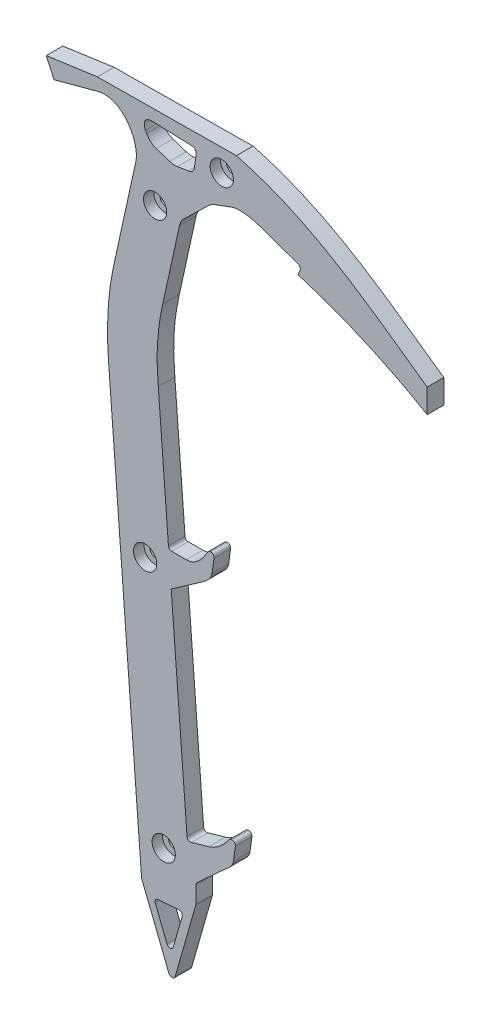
ISO-10303-21;
HEADER;
FILE_DESCRIPTION(('STEP AP214'),'2;1');
FILE_NAME('part.step','',(''),(''),'','','');
FILE_SCHEMA(('AUTOMOTIVE_DESIGN { 1 0 10303 214 1 1 1 1 }'));
ENDSEC;
DATA;
#1=APPLICATION_CONTEXT('core data for automotive mechanical design processes');
#2=APPLICATION_PROTOCOL_DEFINITION('international standard','automotive_design',2000,#1);
#3=PRODUCT_CONTEXT('',#1,'mechanical');
#4=PRODUCT('Part','Part','',(#3));
#5=PRODUCT_RELATED_PRODUCT_CATEGORY('part','',(#4));
#6=PRODUCT_DEFINITION_FORMATION('','',#4);
#7=PRODUCT_DEFINITION_CONTEXT('part definition',#1,'design');
#8=PRODUCT_DEFINITION('design','',#6,#7);
#9=PRODUCT_DEFINITION_SHAPE('','',#8);
#10=(LENGTH_UNIT() NAMED_UNIT(*) SI_UNIT(.MILLI.,.METRE.));
#11=(NAMED_UNIT(*) PLANE_ANGLE_UNIT() SI_UNIT($,.RADIAN.));
#12=(NAMED_UNIT(*) SI_UNIT($,.STERADIAN.) SOLID_ANGLE_UNIT());
#13=UNCERTAINTY_MEASURE_WITH_UNIT(LENGTH_MEASURE(1.E-05),#10,'distance_accuracy_value','');
#14=(GEOMETRIC_REPRESENTATION_CONTEXT(3) GLOBAL_UNCERTAINTY_ASSIGNED_CONTEXT((#13)) GLOBAL_UNIT_ASSIGNED_CONTEXT((#10,
#11,#12)) REPRESENTATION_CONTEXT('',''));
#15=CARTESIAN_POINT('',(0.,0.,0.));
#16=DIRECTION('',(0.,0.,1.));
#17=DIRECTION('',(1.,0.,0.));
#18=AXIS2_PLACEMENT_3D('',#15,#16,#17);
#19=CARTESIAN_POINT('',(-19.0211884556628,12.7458915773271,12.7));
#20=DIRECTION('',(0.,0.,1.));
#21=DIRECTION('',(1.,0.,0.));
#22=AXIS2_PLACEMENT_3D('',#19,#20,#21);
#23=PLANE('',#22);
#24=CARTESIAN_POINT('',(68.0092428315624,147.741681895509,12.7));
#25=DIRECTION('',(0.,0.,1.));
#26=DIRECTION('',(1.,0.,0.));
#27=AXIS2_PLACEMENT_3D('',#24,#25,#26);
#28=CIRCLE('',#27,8.89);
#29=CARTESIAN_POINT('',(76.8992428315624,147.741681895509,12.7));
#30=VERTEX_POINT('',#29);
#31=EDGE_CURVE('E1133',#30,#30,#28,.T.);
#32=ORIENTED_EDGE('',*,*,#31,.F.);
#33=EDGE_LOOP('',(#32));
#34=FACE_BOUND('',#33,.T.);
#35=CARTESIAN_POINT('',(17.0415445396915,100.638187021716,12.7));
#36=DIRECTION('',(0.,0.,1.));
#37=DIRECTION('',(1.,0.,0.));
#38=AXIS2_PLACEMENT_3D('',#35,#36,#37);
#39=CIRCLE('',#38,8.89);
#40=CARTESIAN_POINT('',(25.9315445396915,100.638187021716,12.7));
#41=VERTEX_POINT('',#40);
#42=EDGE_CURVE('E1121',#41,#41,#39,.T.);
#43=ORIENTED_EDGE('',*,*,#42,.F.);
#44=EDGE_LOOP('',(#43));
#45=FACE_BOUND('',#44,.T.);
#46=CARTESIAN_POINT('',(9.38192910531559,-136.197405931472,12.7));
#47=DIRECTION('',(0.,0.,1.));
#48=DIRECTION('',(1.,0.,0.));
#49=AXIS2_PLACEMENT_3D('',#46,#47,#48);
#50=CIRCLE('',#49,8.89);
#51=CARTESIAN_POINT('',(18.2719291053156,-136.197405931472,12.7));
#52=VERTEX_POINT('',#51);
#53=EDGE_CURVE('E1109',#52,#52,#50,.T.);
#54=ORIENTED_EDGE('',*,*,#53,.F.);
#55=EDGE_LOOP('',(#54));
#56=FACE_BOUND('',#55,.T.);
#57=CARTESIAN_POINT('',(23.6115412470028,-321.807230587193,12.7));
#58=DIRECTION('',(0.,0.,1.));
#59=DIRECTION('',(1.,0.,0.));
#60=AXIS2_PLACEMENT_3D('',#57,#58,#59);
#61=CIRCLE('',#60,8.89);
#62=CARTESIAN_POINT('',(32.5015412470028,-321.807230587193,12.7));
#63=VERTEX_POINT('',#62);
#64=EDGE_CURVE('E1097',#63,#63,#61,.T.);
#65=ORIENTED_EDGE('',*,*,#64,.F.);
#66=EDGE_LOOP('',(#65));
#67=FACE_BOUND('',#66,.T.);
#68=DIRECTION('',(0.214363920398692,0.976753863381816,0.));
#69=VECTOR('',#68,1.);
#70=CARTESIAN_POINT('',(39.1921974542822,112.700551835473,12.7));
#71=LINE('',#70,#69);
#72=CARTESIAN_POINT('',(22.8576667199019,38.2719074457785,12.7));
#73=VERTEX_POINT('',#72);
#74=CARTESIAN_POINT('',(35.6487056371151,96.5545543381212,12.7));
#75=VERTEX_POINT('',#74);
#76=EDGE_CURVE('E1066',#73,#75,#71,.T.);
#77=ORIENTED_EDGE('',*,*,#76,.T.);
#78=CARTESIAN_POINT('',(48.0534797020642,93.8321325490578,12.7));
#79=DIRECTION('',(0.,0.,1.));
#80=DIRECTION('',(1.,0.,0.));
#81=AXIS2_PLACEMENT_3D('',#78,#79,#80);
#82=CIRCLE('',#81,12.7);
#83=CARTESIAN_POINT('',(39.2224504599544,102.959176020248,12.7));
#84=VERTEX_POINT('',#83);
#85=EDGE_CURVE('E725',#75,#84,#82,.F.);
#86=ORIENTED_EDGE('',*,*,#85,.T.);
#87=DIRECTION('',(0.718664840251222,0.695356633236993,0.));
#88=VECTOR('',#87,1.);
#89=CARTESIAN_POINT('',(59.9636796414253,123.027712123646,12.7));
#90=LINE('',#89,#88);
#91=CARTESIAN_POINT('',(58.0460163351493,121.172243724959,12.7));
#92=VERTEX_POINT('',#91);
#93=EDGE_CURVE('E809',#84,#92,#90,.T.);
#94=ORIENTED_EDGE('',*,*,#93,.T.);
#95=CARTESIAN_POINT('',(66.8770455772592,112.045200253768,12.7));
#96=DIRECTION('',(0.,0.,1.));
#97=DIRECTION('',(1.,0.,0.));
#98=AXIS2_PLACEMENT_3D('',#95,#96,#97);
#99=CIRCLE('',#98,12.7);
#100=CARTESIAN_POINT('',(62.4659217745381,123.954523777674,12.7));
#101=VERTEX_POINT('',#100);
#102=EDGE_CURVE('E729',#92,#101,#99,.F.);
#103=ORIENTED_EDGE('',*,*,#102,.T.);
#104=DIRECTION('',(0.937742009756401,0.34733258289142,0.));
#105=VECTOR('',#104,1.);
#106=CARTESIAN_POINT('',(44.0168838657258,117.121138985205,12.7));
#107=LINE('',#106,#105);
#108=CARTESIAN_POINT('',(75.9104754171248,128.934285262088,12.7));
#109=VERTEX_POINT('',#108);
#110=EDGE_CURVE('E1062',#101,#109,#107,.T.);
#111=ORIENTED_EDGE('',*,*,#110,.T.);
#112=CARTESIAN_POINT('',(75.9104754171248,128.934285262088,12.7));
#113=CARTESIAN_POINT('',(80.0933409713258,130.483587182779,12.7));
#114=CARTESIAN_POINT('',(89.5482728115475,129.605354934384,12.7));
#115=CARTESIAN_POINT('',(95.8311565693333,127.39608281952,12.7));
#116=B_SPLINE_CURVE_WITH_KNOTS('',3,(#112,#113,#114,#115),.UNSPECIFIED.,.F.,.F.,(4,4),(0.,1.),.UNSPECIFIED.);
#117=CARTESIAN_POINT('',(95.8311565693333,127.39608281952,12.7));
#118=VERTEX_POINT('',#117);
#119=EDGE_CURVE('E1057',#109,#118,#116,.T.);
#120=ORIENTED_EDGE('',*,*,#119,.T.);
#121=DIRECTION('',(0.943376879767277,-0.331722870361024,0.));
#122=VECTOR('',#121,1.);
#123=CARTESIAN_POINT('',(129.004887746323,115.731089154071,12.7));
#124=LINE('',#123,#122);
#125=CARTESIAN_POINT('',(126.42212205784,116.639275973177,12.7));
#126=VERTEX_POINT('',#125);
#127=EDGE_CURVE('E858',#118,#126,#124,.T.);
#128=ORIENTED_EDGE('',*,*,#127,.T.);
#129=CARTESIAN_POINT('',(125.579545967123,114.243098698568,12.7));
#130=DIRECTION('',(0.,0.,1.));
#131=DIRECTION('',(1.,0.,0.));
#132=AXIS2_PLACEMENT_3D('',#129,#130,#131);
#133=CIRCLE('',#132,2.54);
#134=CARTESIAN_POINT('',(127.905938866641,113.223541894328,12.7));
#135=VERTEX_POINT('',#134);
#136=EDGE_CURVE('E855',#126,#135,#133,.F.);
#137=ORIENTED_EDGE('',*,*,#136,.T.);
#138=DIRECTION('',(-0.40140031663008,-0.915902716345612,0.));
#139=VECTOR('',#138,1.);
#140=CARTESIAN_POINT('',(126.268204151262,109.4866099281,12.7));
#141=LINE('',#140,#139);
#142=CARTESIAN_POINT('',(126.268204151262,109.4866099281,12.7));
#143=VERTEX_POINT('',#142);
#144=EDGE_CURVE('E857',#135,#143,#141,.T.);
#145=ORIENTED_EDGE('',*,*,#144,.T.);
#146=CARTESIAN_POINT('',(126.268204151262,109.4866099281,12.7));
#147=CARTESIAN_POINT('',(177.502207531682,94.1506746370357,12.7));
#148=CARTESIAN_POINT('',(225.139902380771,66.1554457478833,12.7));
#149=B_SPLINE_CURVE_WITH_KNOTS('',2,(#146,#147,#148),.UNSPECIFIED.,.F.,.F.,(3,3),(0.,1.),.UNSPECIFIED.);
#150=CARTESIAN_POINT('',(225.139902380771,66.1554457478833,12.7));
#151=VERTEX_POINT('',#150);
#152=EDGE_CURVE('E1030',#143,#151,#149,.T.);
#153=ORIENTED_EDGE('',*,*,#152,.T.);
#154=DIRECTION('',(0.,1.,0.));
#155=VECTOR('',#154,1.);
#156=CARTESIAN_POINT('',(225.139902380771,66.1554457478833,12.7));
#157=LINE('',#156,#155);
#158=CARTESIAN_POINT('',(225.139902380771,84.4452484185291,12.7));
#159=VERTEX_POINT('',#158);
#160=EDGE_CURVE('E1024',#151,#159,#157,.T.);
#161=ORIENTED_EDGE('',*,*,#160,.T.);
#162=CARTESIAN_POINT('',(225.139902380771,84.4452484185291,12.7));
#163=CARTESIAN_POINT('',(177.560633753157,118.105838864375,12.7));
#164=CARTESIAN_POINT('',(136.003162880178,149.987562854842,12.7));
#165=CARTESIAN_POINT('',(79.2400667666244,164.771545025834,12.7));
#166=B_SPLINE_CURVE_WITH_KNOTS('',3,(#162,#163,#164,#165),.UNSPECIFIED.,.F.,.F.,(4,4),(0.,1.),.UNSPECIFIED.);
#167=CARTESIAN_POINT('',(79.2400667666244,164.771545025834,12.7));
#168=VERTEX_POINT('',#167);
#169=EDGE_CURVE('E1018',#159,#168,#166,.T.);
#170=ORIENTED_EDGE('',*,*,#169,.T.);
#171=DIRECTION('',(-0.999958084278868,-0.00915585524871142,0.));
#172=VECTOR('',#171,1.);
#173=CARTESIAN_POINT('',(-27.175390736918,163.797179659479,12.7));
#174=LINE('',#173,#172);
#175=CARTESIAN_POINT('',(-27.0097832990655,163.798696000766,12.7));
#176=VERTEX_POINT('',#175);
#177=EDGE_CURVE('E863',#168,#176,#174,.T.);
#178=ORIENTED_EDGE('',*,*,#177,.T.);
#179=CARTESIAN_POINT('',(-26.9865274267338,161.258802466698,12.7));
#180=DIRECTION('',(0.,0.,1.));
#181=DIRECTION('',(1.,0.,0.));
#182=AXIS2_PLACEMENT_3D('',#179,#180,#181);
#183=CIRCLE('',#182,2.54);
#184=CARTESIAN_POINT('',(-27.339399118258,163.774171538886,12.7));
#185=VERTEX_POINT('',#184);
#186=EDGE_CURVE('E860',#176,#185,#183,.T.);
#187=ORIENTED_EDGE('',*,*,#186,.T.);
#188=DIRECTION('',(-0.990302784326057,-0.138925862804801,0.));
#189=VECTOR('',#188,1.);
#190=CARTESIAN_POINT('',(-66.26296818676,158.313730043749,12.7));
#191=LINE('',#190,#189);
#192=CARTESIAN_POINT('',(-66.26296818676,158.313730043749,12.7));
#193=VERTEX_POINT('',#192);
#194=EDGE_CURVE('E862',#185,#193,#191,.T.);
#195=ORIENTED_EDGE('',*,*,#194,.T.);
#196=DIRECTION('',(0.416827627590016,-0.908985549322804,0.));
#197=VECTOR('',#196,1.);
#198=CARTESIAN_POINT('',(-66.26296818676,158.313730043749,12.7));
#199=LINE('',#198,#197);
#200=CARTESIAN_POINT('',(-60.2950505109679,145.299355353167,12.7));
#201=VERTEX_POINT('',#200);
#202=EDGE_CURVE('E1455',#193,#201,#199,.T.);
#203=ORIENTED_EDGE('',*,*,#202,.T.);
#204=DIRECTION('',(0.96561138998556,0.259989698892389,0.));
#205=VECTOR('',#204,1.);
#206=CARTESIAN_POINT('',(-27.175390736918,154.21678369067,12.7));
#207=LINE('',#206,#205);
#208=CARTESIAN_POINT('',(-27.175390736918,154.21678369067,12.7));
#209=VERTEX_POINT('',#208);
#210=EDGE_CURVE('E986',#201,#209,#207,.T.);
#211=ORIENTED_EDGE('',*,*,#210,.T.);
#212=CARTESIAN_POINT('',(-27.175390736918,154.21678369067,12.7));
#213=CARTESIAN_POINT('',(-21.3119540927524,155.795506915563,12.7));
#214=CARTESIAN_POINT('',(-9.16205195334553,153.443457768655,12.7));
#215=CARTESIAN_POINT('',(1.53650161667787,138.586858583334,12.7));
#216=CARTESIAN_POINT('',(3.295632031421,126.872204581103,12.7));
#217=CARTESIAN_POINT('',(2.22884875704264,122.011383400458,12.7));
#218=B_SPLINE_CURVE_WITH_KNOTS('',3,(#212,#213,#214,#215,#216,#217),.UNSPECIFIED.,.F.,.F.,(4,1,
1,4),(0.,0.318927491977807,0.707775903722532,1.),.UNSPECIFIED.);
#219=CARTESIAN_POINT('',(2.22884875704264,122.011383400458,12.7));
#220=VERTEX_POINT('',#219);
#221=EDGE_CURVE('E981',#209,#220,#218,.T.);
#222=ORIENTED_EDGE('',*,*,#221,.T.);
#223=DIRECTION('',(-0.214363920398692,-0.976753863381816,0.));
#224=VECTOR('',#223,1.);
#225=CARTESIAN_POINT('',(2.22884875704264,122.011383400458,12.7));
#226=LINE('',#225,#224);
#227=CARTESIAN_POINT('',(-14.7862874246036,44.4815454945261,12.7));
#228=VERTEX_POINT('',#227);
#229=EDGE_CURVE('E591',#220,#228,#226,.T.);
#230=ORIENTED_EDGE('',*,*,#229,.T.);
#231=CARTESIAN_POINT('',(-14.7862874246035,44.4815454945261,12.7));
#232=CARTESIAN_POINT('',(-19.2789138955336,24.0107953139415,12.7));
#233=CARTESIAN_POINT('',(-20.3298908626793,2.14529170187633,12.7));
#234=CARTESIAN_POINT('',(-18.5568059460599,-20.9826739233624,12.7));
#235=B_SPLINE_CURVE_WITH_KNOTS('',3,(#231,#232,#233,#234),.UNSPECIFIED.,.F.,.F.,(4,4),(0.,1.),.UNSPECIFIED.);
#236=CARTESIAN_POINT('',(-18.5568059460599,-20.9826739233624,12.7));
#237=VERTEX_POINT('',#236);
#238=EDGE_CURVE('E584',#228,#237,#235,.T.);
#239=ORIENTED_EDGE('',*,*,#238,.T.);
#240=DIRECTION('',(0.0764398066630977,-0.997074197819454,0.));
#241=VECTOR('',#240,1.);
#242=CARTESIAN_POINT('',(-18.5568059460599,-20.9826739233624,12.7));
#243=LINE('',#242,#241);
#244=CARTESIAN_POINT('',(6.65403011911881,-349.830629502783,12.7));
#245=VERTEX_POINT('',#244);
#246=EDGE_CURVE('E590',#237,#245,#243,.T.);
#247=ORIENTED_EDGE('',*,*,#246,.T.);
#248=CARTESIAN_POINT('',(9.18659858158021,-349.636472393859,12.7));
#249=DIRECTION('',(0.,0.,1.));
#250=DIRECTION('',(1.,0.,0.));
#251=AXIS2_PLACEMENT_3D('',#248,#249,#250);
#252=CIRCLE('',#251,2.54);
#253=CARTESIAN_POINT('',(6.82682358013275,-350.576186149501,12.7));
#254=VERTEX_POINT('',#253);
#255=EDGE_CURVE('E1315',#245,#254,#252,.T.);
#256=ORIENTED_EDGE('',*,*,#255,.T.);
#257=DIRECTION('',(0.369966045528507,-0.929045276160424,0.));
#258=VECTOR('',#257,1.);
#259=CARTESIAN_POINT('',(30.3446481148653,-409.633291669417,12.7));
#260=LINE('',#259,#258);
#261=CARTESIAN_POINT('',(27.5845787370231,-402.702305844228,12.7));
#262=VERTEX_POINT('',#261);
#263=EDGE_CURVE('E827',#254,#262,#260,.T.);
#264=ORIENTED_EDGE('',*,*,#263,.T.);
#265=CARTESIAN_POINT('',(29.9443537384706,-401.762592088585,12.7));
#266=DIRECTION('',(0.,0.,1.));
#267=DIRECTION('',(1.,0.,0.));
#268=AXIS2_PLACEMENT_3D('',#265,#266,#267);
#269=CIRCLE('',#268,2.54);
#270=CARTESIAN_POINT('',(32.3872913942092,-402.458045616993,12.7));
#271=VERTEX_POINT('',#270);
#272=EDGE_CURVE('E1313',#262,#271,#269,.T.);
#273=ORIENTED_EDGE('',*,*,#272,.T.);
#274=DIRECTION('',(0.273800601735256,0.961786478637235,0.));
#275=VECTOR('',#274,1.);
#276=CARTESIAN_POINT('',(48.1646619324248,-347.036466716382,12.7));
#277=LINE('',#276,#275);
#278=CARTESIAN_POINT('',(48.0675995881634,-347.377420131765,12.7));
#279=VERTEX_POINT('',#278);
#280=EDGE_CURVE('E830',#271,#279,#277,.T.);
#281=ORIENTED_EDGE('',*,*,#280,.T.);
#282=CARTESIAN_POINT('',(45.6246619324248,-346.681966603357,12.7));
#283=DIRECTION('',(0.,0.,1.));
#284=DIRECTION('',(1.,0.,0.));
#285=AXIS2_PLACEMENT_3D('',#282,#283,#284);
#286=CIRCLE('',#285,2.54);
#287=CARTESIAN_POINT('',(48.1646619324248,-346.681966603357,12.7));
#288=VERTEX_POINT('',#287);
#289=EDGE_CURVE('E835',#279,#288,#286,.T.);
#290=ORIENTED_EDGE('',*,*,#289,.T.);
#291=DIRECTION('',(0.,1.,0.));
#292=VECTOR('',#291,1.);
#293=CARTESIAN_POINT('',(48.1646619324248,-332.698935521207,12.7));
#294=LINE('',#293,#292);
#295=CARTESIAN_POINT('',(48.1646619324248,-333.81690500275,12.7));
#296=VERTEX_POINT('',#295);
#297=EDGE_CURVE('E455',#288,#296,#294,.T.);
#298=ORIENTED_EDGE('',*,*,#297,.T.);
#299=CARTESIAN_POINT('',(50.7046619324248,-333.81690500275,12.7));
#300=DIRECTION('',(0.,0.,1.));
#301=DIRECTION('',(1.,0.,0.));
#302=AXIS2_PLACEMENT_3D('',#299,#300,#301);
#303=CIRCLE('',#302,2.54);
#304=CARTESIAN_POINT('',(48.9890862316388,-331.943832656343,12.7));
#305=VERTEX_POINT('',#304);
#306=EDGE_CURVE('E451',#296,#305,#303,.F.);
#307=ORIENTED_EDGE('',*,*,#306,.T.);
#308=DIRECTION('',(0.737430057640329,0.675423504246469,0.));
#309=VECTOR('',#308,1.);
#310=CARTESIAN_POINT('',(48.1646619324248,-332.698935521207,12.7));
#311=LINE('',#310,#309);
#312=CARTESIAN_POINT('',(69.0746525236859,-313.547154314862,12.7));
#313=VERTEX_POINT('',#312);
#314=EDGE_CURVE('E442',#305,#313,#311,.T.);
#315=ORIENTED_EDGE('',*,*,#314,.T.);
#316=CARTESIAN_POINT('',(69.0746525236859,-313.547154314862,12.7));
#317=CARTESIAN_POINT('',(72.1842997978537,-310.698980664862,12.7));
#318=CARTESIAN_POINT('',(76.3504602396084,-308.232220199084,12.7));
#319=CARTESIAN_POINT('',(76.9663603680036,-303.659842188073,12.7));
#320=B_SPLINE_CURVE_WITH_KNOTS('',3,(#316,#317,#318,#319),.UNSPECIFIED.,.F.,.F.,(4,4),(0.,1.),.UNSPECIFIED.);
#321=CARTESIAN_POINT('',(76.9663603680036,-303.659842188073,12.7));
#322=VERTEX_POINT('',#321);
#323=EDGE_CURVE('E447',#313,#322,#320,.T.);
#324=ORIENTED_EDGE('',*,*,#323,.T.);
#325=DIRECTION('',(0.133494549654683,0.99104954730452,0.));
#326=VECTOR('',#325,1.);
#327=CARTESIAN_POINT('',(78.7824480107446,-290.177397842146,12.7));
#328=LINE('',#327,#326);
#329=CARTESIAN_POINT('',(78.394635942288,-293.056473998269,12.7));
#330=VERTEX_POINT('',#329);
#331=EDGE_CURVE('E470',#322,#330,#328,.T.);
#332=ORIENTED_EDGE('',*,*,#331,.T.);
#333=CARTESIAN_POINT('',(75.8773700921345,-292.717397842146,12.7));
#334=DIRECTION('',(0.,0.,1.));
#335=DIRECTION('',(1.,0.,0.));
#336=AXIS2_PLACEMENT_3D('',#333,#334,#335);
#337=CIRCLE('',#336,2.54);
#338=CARTESIAN_POINT('',(75.8773700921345,-290.177397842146,12.7));
#339=VERTEX_POINT('',#338);
#340=EDGE_CURVE('E1308',#330,#339,#337,.T.);
#341=ORIENTED_EDGE('',*,*,#340,.T.);
#342=DIRECTION('',(-1.,0.,0.));
#343=VECTOR('',#342,1.);
#344=CARTESIAN_POINT('',(78.7824480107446,-290.177397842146,12.7));
#345=LINE('',#344,#343);
#346=CARTESIAN_POINT('',(75.6592750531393,-290.177397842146,12.7));
#347=VERTEX_POINT('',#346);
#348=EDGE_CURVE('E472',#339,#347,#345,.T.);
#349=ORIENTED_EDGE('',*,*,#348,.T.);
#350=CARTESIAN_POINT('',(75.6592750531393,-292.717397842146,12.7));
#351=DIRECTION('',(0.,0.,1.));
#352=DIRECTION('',(1.,0.,0.));
#353=AXIS2_PLACEMENT_3D('',#350,#351,#352);
#354=CIRCLE('',#353,2.54);
#355=CARTESIAN_POINT('',(73.5943919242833,-291.238256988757,12.7));
#356=VERTEX_POINT('',#355);
#357=EDGE_CURVE('E1310',#347,#356,#354,.T.);
#358=ORIENTED_EDGE('',*,*,#357,.T.);
#359=CARTESIAN_POINT('',(74.3357910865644,-290.177397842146,12.7));
#360=CARTESIAN_POINT('',(66.9349578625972,-301.027986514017,12.7));
#361=CARTESIAN_POINT('',(58.0168664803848,-303.581901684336,12.7));
#362=B_SPLINE_CURVE_WITH_KNOTS('',2,(#359,#360,#361),.UNSPECIFIED.,.F.,.F.,(3,3),(0.,1.),.UNSPECIFIED.);
#363=CARTESIAN_POINT('',(58.0168664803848,-303.581901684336,12.7));
#364=VERTEX_POINT('',#363);
#365=EDGE_CURVE('E1499',#356,#364,#362,.T.);
#366=ORIENTED_EDGE('',*,*,#365,.T.);
#367=DIRECTION('',(-0.96135607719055,-0.275307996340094,0.));
#368=VECTOR('',#367,1.);
#369=CARTESIAN_POINT('',(41.6789069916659,-308.260678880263,12.7));
#370=LINE('',#369,#368);
#371=CARTESIAN_POINT('',(44.6727128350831,-307.403328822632,12.7));
#372=VERTEX_POINT('',#371);
#373=EDGE_CURVE('E1502',#364,#372,#370,.T.);
#374=ORIENTED_EDGE('',*,*,#373,.T.);
#375=CARTESIAN_POINT('',(43.9734305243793,-304.961484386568,12.7));
#376=DIRECTION('',(0.,0.,1.));
#377=DIRECTION('',(1.,0.,0.));
#378=AXIS2_PLACEMENT_3D('',#375,#376,#377);
#379=CIRCLE('',#378,2.54);
#380=CARTESIAN_POINT('',(41.4408620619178,-305.155641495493,12.7));
#381=VERTEX_POINT('',#380);
#382=EDGE_CURVE('E844',#372,#381,#379,.F.);
#383=ORIENTED_EDGE('',*,*,#382,.T.);
#384=DIRECTION('',(-0.0764398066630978,0.997074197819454,0.));
#385=VECTOR('',#384,1.);
#386=CARTESIAN_POINT('',(29.3333298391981,-147.226042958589,12.7));
#387=LINE('',#386,#385);
#388=CARTESIAN_POINT('',(29.3333298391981,-147.226042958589,12.7));
#389=VERTEX_POINT('',#388);
#390=EDGE_CURVE('E1504',#381,#389,#387,.T.);
#391=ORIENTED_EDGE('',*,*,#390,.T.);
#392=DIRECTION('',(0.82040362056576,0.571784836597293,0.));
#393=VECTOR('',#392,1.);
#394=CARTESIAN_POINT('',(29.3333298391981,-147.226042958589,12.7));
#395=LINE('',#394,#393);
#396=CARTESIAN_POINT('',(52.7557279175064,-130.901673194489,12.7));
#397=VERTEX_POINT('',#396);
#398=EDGE_CURVE('E2122',#389,#397,#395,.T.);
#399=ORIENTED_EDGE('',*,*,#398,.T.);
#400=CARTESIAN_POINT('',(52.7557279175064,-130.901673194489,12.7));
#401=CARTESIAN_POINT('',(56.2152639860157,-128.490530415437,12.7));
#402=CARTESIAN_POINT('',(60.0315356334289,-125.586739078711,12.7));
#403=CARTESIAN_POINT('',(60.6474357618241,-121.0143610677,12.7));
#404=B_SPLINE_CURVE_WITH_KNOTS('',3,(#400,#401,#402,#403),.UNSPECIFIED.,.F.,.F.,(4,4),(0.,1.),.UNSPECIFIED.);
#405=CARTESIAN_POINT('',(60.6474357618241,-121.0143610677,12.7));
#406=VERTEX_POINT('',#405);
#407=EDGE_CURVE('E1400',#397,#406,#404,.T.);
#408=ORIENTED_EDGE('',*,*,#407,.T.);
#409=DIRECTION('',(0.133494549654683,0.99104954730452,0.));
#410=VECTOR('',#409,1.);
#411=CARTESIAN_POINT('',(62.4635234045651,-107.531916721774,12.7));
#412=LINE('',#411,#410);
#413=CARTESIAN_POINT('',(62.0757113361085,-110.410992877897,12.7));
#414=VERTEX_POINT('',#413);
#415=EDGE_CURVE('E1394',#406,#414,#412,.T.);
#416=ORIENTED_EDGE('',*,*,#415,.T.);
#417=CARTESIAN_POINT('',(59.558445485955,-110.071916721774,12.7));
#418=DIRECTION('',(0.,0.,1.));
#419=DIRECTION('',(1.,0.,0.));
#420=AXIS2_PLACEMENT_3D('',#417,#418,#419);
#421=CIRCLE('',#420,2.54);
#422=CARTESIAN_POINT('',(59.558445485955,-107.531916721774,12.7));
#423=VERTEX_POINT('',#422);
#424=EDGE_CURVE('E1304',#414,#423,#421,.T.);
#425=ORIENTED_EDGE('',*,*,#424,.T.);
#426=DIRECTION('',(-1.,0.,0.));
#427=VECTOR('',#426,1.);
#428=CARTESIAN_POINT('',(62.4635234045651,-107.531916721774,12.7));
#429=LINE('',#428,#427);
#430=CARTESIAN_POINT('',(59.5153247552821,-107.531916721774,12.7));
#431=VERTEX_POINT('',#430);
#432=EDGE_CURVE('E1194',#423,#431,#429,.T.);
#433=ORIENTED_EDGE('',*,*,#432,.T.);
#434=CARTESIAN_POINT('',(59.5153247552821,-110.071916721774,12.7));
#435=DIRECTION('',(0.,0.,1.));
#436=DIRECTION('',(1.,0.,0.));
#437=AXIS2_PLACEMENT_3D('',#434,#435,#436);
#438=CIRCLE('',#437,2.54);
#439=CARTESIAN_POINT('',(57.3066049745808,-108.817661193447,12.7));
#440=VERTEX_POINT('',#439);
#441=EDGE_CURVE('E1306',#431,#440,#438,.T.);
#442=ORIENTED_EDGE('',*,*,#441,.T.);
#443=CARTESIAN_POINT('',(58.0168664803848,-107.531916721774,12.7));
#444=CARTESIAN_POINT('',(50.1965242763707,-122.077096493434,12.7));
#445=CARTESIAN_POINT('',(40.9199496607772,-122.077096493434,12.7));
#446=B_SPLINE_CURVE_WITH_KNOTS('',2,(#443,#444,#445),.UNSPECIFIED.,.F.,.F.,(3,3),(0.,1.),.UNSPECIFIED.);
#447=CARTESIAN_POINT('',(40.9199496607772,-122.077096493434,12.7));
#448=VERTEX_POINT('',#447);
#449=EDGE_CURVE('E1187',#440,#448,#446,.T.);
#450=ORIENTED_EDGE('',*,*,#449,.T.);
#451=DIRECTION('',(-1.,0.,0.));
#452=VECTOR('',#451,1.);
#453=CARTESIAN_POINT('',(27.4053082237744,-122.077096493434,12.7));
#454=LINE('',#453,#452);
#455=CARTESIAN_POINT('',(29.7580347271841,-122.077096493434,12.7));
#456=VERTEX_POINT('',#455);
#457=EDGE_CURVE('E1193',#448,#456,#454,.T.);
#458=ORIENTED_EDGE('',*,*,#457,.T.);
#459=CARTESIAN_POINT('',(29.7580347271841,-119.537096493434,12.7));
#460=DIRECTION('',(0.,0.,1.));
#461=DIRECTION('',(1.,0.,0.));
#462=AXIS2_PLACEMENT_3D('',#459,#460,#461);
#463=CIRCLE('',#462,2.54);
#464=CARTESIAN_POINT('',(27.2254662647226,-119.731253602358,12.7));
#465=VERTEX_POINT('',#464);
#466=EDGE_CURVE('E756',#456,#465,#463,.F.);
#467=ORIENTED_EDGE('',*,*,#466,.T.);
#468=DIRECTION('',(-0.0764398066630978,0.997074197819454,0.));
#469=VECTOR('',#468,1.);
#470=CARTESIAN_POINT('',(33.2300214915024,-198.054150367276,12.7));
#471=LINE('',#470,#469);
#472=CARTESIAN_POINT('',(19.4317209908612,-18.0703172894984,12.7));
#473=VERTEX_POINT('',#472);
#474=EDGE_CURVE('E754',#465,#473,#471,.T.);
#475=ORIENTED_EDGE('',*,*,#474,.T.);
#476=CARTESIAN_POINT('',(19.4317209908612,-18.0703172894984,12.7));
#477=CARTESIAN_POINT('',(17.9934732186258,0.690061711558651,12.7));
#478=CARTESIAN_POINT('',(17.7895180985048,15.1787780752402,12.7));
#479=CARTESIAN_POINT('',(22.8576667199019,38.2719074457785,12.7));
#480=B_SPLINE_CURVE_WITH_KNOTS('',3,(#476,#477,#478,#479),.UNSPECIFIED.,.F.,.F.,(4,4),(0.,1.),.UNSPECIFIED.);
#481=EDGE_CURVE('E592',#473,#73,#480,.T.);
#482=ORIENTED_EDGE('',*,*,#481,.T.);
#483=EDGE_LOOP('',(#77,#86,#94,#103,#111,#120,#128,#137,#145,#153,#161,#170,#178,#187,#195,#203,
#211,#222,#230,#239,#247,#256,#264,#273,#281,#290,#298,#307,#315,#324,#332,#341,#349,#358,#366,
#374,#383,#391,#399,#408,#416,#425,#433,#442,#450,#458,#467,#475,#482));
#484=FACE_BOUND('',#483,.T.);
#485=DIRECTION('',(0.450091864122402,-0.892982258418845,0.));
#486=VECTOR('',#485,1.);
#487=CARTESIAN_POINT('',(9.73340656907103,146.855761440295,12.7));
#488=LINE('',#487,#486);
#489=CARTESIAN_POINT('',(9.73340656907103,146.855761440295,12.7));
#490=VERTEX_POINT('',#489);
#491=CARTESIAN_POINT('',(10.5709948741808,145.193986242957,12.7));
#492=VERTEX_POINT('',#491);
#493=EDGE_CURVE('E603',#490,#492,#488,.T.);
#494=ORIENTED_EDGE('',*,*,#493,.F.);
#495=CARTESIAN_POINT('',(15.7887965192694,155.37436086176,12.7));
#496=CARTESIAN_POINT('',(7.67842661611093,155.695324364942,12.7));
#497=CARTESIAN_POINT('',(8.16535843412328,149.966768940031,12.7));
#498=CARTESIAN_POINT('',(9.73340656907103,146.855761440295,12.7));
#499=B_SPLINE_CURVE_WITH_KNOTS('',3,(#495,#496,#497,#498),.UNSPECIFIED.,.F.,.F.,(4,4),(0.,1.),.UNSPECIFIED.);
#500=CARTESIAN_POINT('',(15.7887965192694,155.37436086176,12.7));
#501=VERTEX_POINT('',#500);
#502=EDGE_CURVE('E604',#501,#490,#499,.T.);
#503=ORIENTED_EDGE('',*,*,#502,.F.);
#504=DIRECTION('',(-0.999217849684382,0.0395435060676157,0.));
#505=VECTOR('',#504,1.);
#506=CARTESIAN_POINT('',(15.7887965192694,155.37436086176,12.7));
#507=LINE('',#506,#505);
#508=CARTESIAN_POINT('',(45.0394089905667,154.21678369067,12.7));
#509=VERTEX_POINT('',#508);
#510=EDGE_CURVE('E618',#509,#501,#507,.T.);
#511=ORIENTED_EDGE('',*,*,#510,.F.);
#512=CARTESIAN_POINT('',(48.426322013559,150.499258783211,12.7));
#513=CARTESIAN_POINT('',(48.6578242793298,152.171219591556,12.7));
#514=CARTESIAN_POINT('',(47.6866953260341,154.112018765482,12.7));
#515=CARTESIAN_POINT('',(45.0394089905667,154.21678369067,12.7));
#516=B_SPLINE_CURVE_WITH_KNOTS('',3,(#512,#513,#514,#515),.UNSPECIFIED.,.F.,.F.,(4,4),(0.,1.),.UNSPECIFIED.);
#517=CARTESIAN_POINT('',(48.426322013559,150.499258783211,12.7));
#518=VERTEX_POINT('',#517);
#519=EDGE_CURVE('E615',#518,#509,#516,.T.);
#520=ORIENTED_EDGE('',*,*,#519,.F.);
#521=DIRECTION('',(0.13715305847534,0.990549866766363,0.));
#522=VECTOR('',#521,1.);
#523=CARTESIAN_POINT('',(48.426322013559,150.499258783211,12.7));
#524=LINE('',#523,#522);
#525=CARTESIAN_POINT('',(47.0407666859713,140.492470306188,12.7));
#526=VERTEX_POINT('',#525);
#527=EDGE_CURVE('E612',#526,#518,#524,.T.);
#528=ORIENTED_EDGE('',*,*,#527,.F.);
#529=CARTESIAN_POINT('',(42.3709320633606,136.233170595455,12.7));
#530=CARTESIAN_POINT('',(45.2602948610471,136.674143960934,12.7));
#531=CARTESIAN_POINT('',(46.7518070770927,138.40553979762,12.7));
#532=CARTESIAN_POINT('',(47.0407666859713,140.492470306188,12.7));
#533=B_SPLINE_CURVE_WITH_KNOTS('',3,(#529,#530,#531,#532),.UNSPECIFIED.,.F.,.F.,(4,4),(0.,1.),.UNSPECIFIED.);
#534=CARTESIAN_POINT('',(42.3709320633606,136.233170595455,12.7));
#535=VERTEX_POINT('',#534);
#536=EDGE_CURVE('E608',#535,#526,#533,.T.);
#537=ORIENTED_EDGE('',*,*,#536,.F.);
#538=DIRECTION('',(0.988553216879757,0.150872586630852,0.));
#539=VECTOR('',#538,1.);
#540=CARTESIAN_POINT('',(19.8428287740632,132.794940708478,12.7));
#541=LINE('',#540,#539);
#542=CARTESIAN_POINT('',(34.1086610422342,134.97218617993,12.7));
#543=VERTEX_POINT('',#542);
#544=EDGE_CURVE('E609',#543,#535,#541,.T.);
#545=ORIENTED_EDGE('',*,*,#544,.F.);
#546=CARTESIAN_POINT('',(32.1925791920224,147.526812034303,12.7));
#547=DIRECTION('',(0.,0.,1.));
#548=DIRECTION('',(1.,0.,0.));
#549=AXIS2_PLACEMENT_3D('',#546,#547,#548);
#550=CIRCLE('',#549,12.7);
#551=CARTESIAN_POINT('',(28.2225208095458,135.463286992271,12.7));
#552=VERTEX_POINT('',#551);
#553=EDGE_CURVE('E719',#543,#552,#550,.F.);
#554=ORIENTED_EDGE('',*,*,#553,.T.);
#555=DIRECTION('',(-0.949883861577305,0.312603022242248,0.));
#556=VECTOR('',#555,1.);
#557=CARTESIAN_POINT('',(12.9407105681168,140.492470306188,12.7));
#558=LINE('',#557,#556);
#559=CARTESIAN_POINT('',(17.9418111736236,138.84662787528,12.7));
#560=VERTEX_POINT('',#559);
#561=EDGE_CURVE('E801',#552,#560,#558,.T.);
#562=ORIENTED_EDGE('',*,*,#561,.T.);
#563=CARTESIAN_POINT('',(21.9118695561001,150.910152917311,12.7));
#564=DIRECTION('',(0.,0.,1.));
#565=DIRECTION('',(1.,0.,0.));
#566=AXIS2_PLACEMENT_3D('',#563,#564,#565);
#567=CIRCLE('',#566,12.7);
#568=EDGE_CURVE('E45',#560,#492,#567,.F.);
#569=ORIENTED_EDGE('',*,*,#568,.T.);
#570=EDGE_LOOP('',(#494,#503,#511,#520,#528,#537,#545,#554,#562,#569));
#571=FACE_BOUND('',#570,.T.);
#572=DIRECTION('',(-0.997074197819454,-0.0764398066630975,0.));
#573=VECTOR('',#572,1.);
#574=CARTESIAN_POINT('',(15.9069158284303,-358.224789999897,12.7));
#575=LINE('',#574,#573);
#576=CARTESIAN_POINT('',(35.0607016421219,-356.756382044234,12.7));
#577=VERTEX_POINT('',#576);
#578=CARTESIAN_POINT('',(19.3501523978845,-357.960817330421,12.7));
#579=VERTEX_POINT('',#578);
#580=EDGE_CURVE('E815',#577,#579,#575,.T.);
#581=ORIENTED_EDGE('',*,*,#580,.F.);
#582=CARTESIAN_POINT('',(35.2548587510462,-359.288950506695,12.7));
#583=DIRECTION('',(0.,0.,1.));
#584=DIRECTION('',(1.,0.,0.));
#585=AXIS2_PLACEMENT_3D('',#582,#583,#584);
#586=CIRCLE('',#585,2.54);
#587=CARTESIAN_POINT('',(37.6977964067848,-359.984404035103,12.7));
#588=VERTEX_POINT('',#587);
#589=EDGE_CURVE('E846',#577,#588,#586,.F.);
#590=ORIENTED_EDGE('',*,*,#589,.T.);
#591=DIRECTION('',(0.273800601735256,0.961786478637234,0.));
#592=VECTOR('',#591,1.);
#593=CARTESIAN_POINT('',(28.905993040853,-390.867599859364,12.7));
#594=LINE('',#593,#592);
#595=CARTESIAN_POINT('',(30.9486363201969,-383.69235380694,12.7));
#596=VERTEX_POINT('',#595);
#597=EDGE_CURVE('E812',#596,#588,#594,.T.);
#598=ORIENTED_EDGE('',*,*,#597,.F.);
#599=CARTESIAN_POINT('',(28.5056986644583,-382.996900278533,12.7));
#600=DIRECTION('',(0.,0.,1.));
#601=DIRECTION('',(1.,0.,0.));
#602=AXIS2_PLACEMENT_3D('',#599,#600,#601);
#603=CIRCLE('',#602,2.54);
#604=CARTESIAN_POINT('',(26.1459236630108,-383.936614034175,12.7));
#605=VERTEX_POINT('',#604);
#606=EDGE_CURVE('E1366',#596,#605,#603,.F.);
#607=ORIENTED_EDGE('',*,*,#606,.T.);
#608=DIRECTION('',(0.369966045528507,-0.929045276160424,0.));
#609=VECTOR('',#608,1.);
#610=CARTESIAN_POINT('',(15.9069158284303,-358.224789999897,12.7));
#611=LINE('',#610,#609);
#612=CARTESIAN_POINT('',(17.1845345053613,-361.433099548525,12.7));
#613=VERTEX_POINT('',#612);
#614=EDGE_CURVE('E819',#613,#605,#611,.T.);
#615=ORIENTED_EDGE('',*,*,#614,.F.);
#616=CARTESIAN_POINT('',(19.5443095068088,-360.493385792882,12.7));
#617=DIRECTION('',(0.,0.,1.));
#618=DIRECTION('',(1.,0.,0.));
#619=AXIS2_PLACEMENT_3D('',#616,#617,#618);
#620=CIRCLE('',#619,2.54);
#621=EDGE_CURVE('E1370',#613,#579,#620,.F.);
#622=ORIENTED_EDGE('',*,*,#621,.T.);
#623=EDGE_LOOP('',(#581,#590,#598,#607,#615,#622));
#624=FACE_BOUND('',#623,.T.);
#625=ADVANCED_FACE('F37',(#34,#45,#56,#67,#484,#571,#624),#23,.T.);
#626=CARTESIAN_POINT('',(-19.0211884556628,12.7458915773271,0.));
#627=DIRECTION('',(0.,0.,1.));
#628=DIRECTION('',(1.,0.,0.));
#629=AXIS2_PLACEMENT_3D('',#626,#627,#628);
#630=PLANE('',#629);
#631=CARTESIAN_POINT('',(68.0092428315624,147.741681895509,0.));
#632=DIRECTION('',(0.,0.,1.));
#633=DIRECTION('',(1.,0.,0.));
#634=AXIS2_PLACEMENT_3D('',#631,#632,#633);
#635=CIRCLE('',#634,4.21640000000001);
#636=CARTESIAN_POINT('',(72.2256428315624,147.741681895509,0.));
#637=VERTEX_POINT('',#636);
#638=EDGE_CURVE('E1124',#637,#637,#635,.T.);
#639=ORIENTED_EDGE('',*,*,#638,.T.);
#640=EDGE_LOOP('',(#639));
#641=FACE_BOUND('',#640,.T.);
#642=CARTESIAN_POINT('',(17.0415445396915,100.638187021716,0.));
#643=DIRECTION('',(0.,0.,1.));
#644=DIRECTION('',(1.,0.,0.));
#645=AXIS2_PLACEMENT_3D('',#642,#643,#644);
#646=CIRCLE('',#645,4.21640000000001);
#647=CARTESIAN_POINT('',(21.2579445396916,100.638187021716,0.));
#648=VERTEX_POINT('',#647);
#649=EDGE_CURVE('E1112',#648,#648,#646,.T.);
#650=ORIENTED_EDGE('',*,*,#649,.T.);
#651=EDGE_LOOP('',(#650));
#652=FACE_BOUND('',#651,.T.);
#653=CARTESIAN_POINT('',(9.38192910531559,-136.197405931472,0.));
#654=DIRECTION('',(0.,0.,1.));
#655=DIRECTION('',(1.,0.,0.));
#656=AXIS2_PLACEMENT_3D('',#653,#654,#655);
#657=CIRCLE('',#656,4.21640000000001);
#658=CARTESIAN_POINT('',(13.5983291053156,-136.197405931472,0.));
#659=VERTEX_POINT('',#658);
#660=EDGE_CURVE('E1100',#659,#659,#657,.T.);
#661=ORIENTED_EDGE('',*,*,#660,.T.);
#662=EDGE_LOOP('',(#661));
#663=FACE_BOUND('',#662,.T.);
#664=CARTESIAN_POINT('',(23.6115412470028,-321.807230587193,0.));
#665=DIRECTION('',(0.,0.,1.));
#666=DIRECTION('',(1.,0.,0.));
#667=AXIS2_PLACEMENT_3D('',#664,#665,#666);
#668=CIRCLE('',#667,4.21640000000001);
#669=CARTESIAN_POINT('',(27.8279412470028,-321.807230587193,0.));
#670=VERTEX_POINT('',#669);
#671=EDGE_CURVE('E1085',#670,#670,#668,.T.);
#672=ORIENTED_EDGE('',*,*,#671,.T.);
#673=EDGE_LOOP('',(#672));
#674=FACE_BOUND('',#673,.T.);
#675=DIRECTION('',(0.450091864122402,-0.892982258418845,0.));
#676=VECTOR('',#675,1.);
#677=CARTESIAN_POINT('',(9.73340656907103,146.855761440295,0.));
#678=LINE('',#677,#676);
#679=CARTESIAN_POINT('',(9.73340656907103,146.855761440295,0.));
#680=VERTEX_POINT('',#679);
#681=CARTESIAN_POINT('',(10.5709948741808,145.193986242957,0.));
#682=VERTEX_POINT('',#681);
#683=EDGE_CURVE('E648',#680,#682,#678,.T.);
#684=ORIENTED_EDGE('',*,*,#683,.T.);
#685=CARTESIAN_POINT('',(21.9118695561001,150.910152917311,0.));
#686=DIRECTION('',(0.,0.,1.));
#687=DIRECTION('',(1.,0.,0.));
#688=AXIS2_PLACEMENT_3D('',#685,#686,#687);
#689=CIRCLE('',#688,12.7);
#690=CARTESIAN_POINT('',(17.9418111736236,138.84662787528,0.));
#691=VERTEX_POINT('',#690);
#692=EDGE_CURVE('E11',#682,#691,#689,.T.);
#693=ORIENTED_EDGE('',*,*,#692,.T.);
#694=DIRECTION('',(0.949883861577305,-0.312603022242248,0.));
#695=VECTOR('',#694,1.);
#696=CARTESIAN_POINT('',(12.9407105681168,140.492470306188,0.));
#697=LINE('',#696,#695);
#698=CARTESIAN_POINT('',(28.2225208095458,135.463286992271,0.));
#699=VERTEX_POINT('',#698);
#700=EDGE_CURVE('E797',#691,#699,#697,.T.);
#701=ORIENTED_EDGE('',*,*,#700,.T.);
#702=CARTESIAN_POINT('',(32.1925791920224,147.526812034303,0.));
#703=DIRECTION('',(0.,0.,1.));
#704=DIRECTION('',(1.,0.,0.));
#705=AXIS2_PLACEMENT_3D('',#702,#703,#704);
#706=CIRCLE('',#705,12.7);
#707=CARTESIAN_POINT('',(34.1086610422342,134.97218617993,0.));
#708=VERTEX_POINT('',#707);
#709=EDGE_CURVE('E712',#699,#708,#706,.T.);
#710=ORIENTED_EDGE('',*,*,#709,.T.);
#711=DIRECTION('',(0.988553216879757,0.150872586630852,0.));
#712=VECTOR('',#711,1.);
#713=CARTESIAN_POINT('',(19.8428287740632,132.794940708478,0.));
#714=LINE('',#713,#712);
#715=CARTESIAN_POINT('',(42.3709320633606,136.233170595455,0.));
#716=VERTEX_POINT('',#715);
#717=EDGE_CURVE('E643',#708,#716,#714,.T.);
#718=ORIENTED_EDGE('',*,*,#717,.T.);
#719=CARTESIAN_POINT('',(42.3709320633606,136.233170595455,0.));
#720=CARTESIAN_POINT('',(45.2602948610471,136.674143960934,0.));
#721=CARTESIAN_POINT('',(46.7518070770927,138.40553979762,0.));
#722=CARTESIAN_POINT('',(47.0407666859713,140.492470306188,0.));
#723=B_SPLINE_CURVE_WITH_KNOTS('',3,(#719,#720,#721,#722),.UNSPECIFIED.,.F.,.F.,(4,4),(0.,1.),.UNSPECIFIED.);
#724=CARTESIAN_POINT('',(47.0407666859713,140.492470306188,0.));
#725=VERTEX_POINT('',#724);
#726=EDGE_CURVE('E638',#716,#725,#723,.T.);
#727=ORIENTED_EDGE('',*,*,#726,.T.);
#728=DIRECTION('',(0.13715305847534,0.990549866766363,0.));
#729=VECTOR('',#728,1.);
#730=CARTESIAN_POINT('',(48.426322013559,150.499258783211,0.));
#731=LINE('',#730,#729);
#732=CARTESIAN_POINT('',(48.426322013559,150.499258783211,0.));
#733=VERTEX_POINT('',#732);
#734=EDGE_CURVE('E632',#725,#733,#731,.T.);
#735=ORIENTED_EDGE('',*,*,#734,.T.);
#736=CARTESIAN_POINT('',(48.426322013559,150.499258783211,0.));
#737=CARTESIAN_POINT('',(48.6578242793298,152.171219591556,0.));
#738=CARTESIAN_POINT('',(47.6866953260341,154.112018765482,0.));
#739=CARTESIAN_POINT('',(45.0394089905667,154.21678369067,0.));
#740=B_SPLINE_CURVE_WITH_KNOTS('',3,(#736,#737,#738,#739),.UNSPECIFIED.,.F.,.F.,(4,4),(0.,1.),.UNSPECIFIED.);
#741=CARTESIAN_POINT('',(45.0394089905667,154.21678369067,0.));
#742=VERTEX_POINT('',#741);
#743=EDGE_CURVE('E627',#733,#742,#740,.T.);
#744=ORIENTED_EDGE('',*,*,#743,.T.);
#745=DIRECTION('',(-0.999217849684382,0.0395435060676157,0.));
#746=VECTOR('',#745,1.);
#747=CARTESIAN_POINT('',(15.7887965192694,155.37436086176,0.));
#748=LINE('',#747,#746);
#749=CARTESIAN_POINT('',(15.7887965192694,155.37436086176,0.));
#750=VERTEX_POINT('',#749);
#751=EDGE_CURVE('E623',#742,#750,#748,.T.);
#752=ORIENTED_EDGE('',*,*,#751,.T.);
#753=CARTESIAN_POINT('',(15.7887965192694,155.37436086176,0.));
#754=CARTESIAN_POINT('',(7.67842661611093,155.695324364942,0.));
#755=CARTESIAN_POINT('',(8.16535843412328,149.966768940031,0.));
#756=CARTESIAN_POINT('',(9.73340656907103,146.855761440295,0.));
#757=B_SPLINE_CURVE_WITH_KNOTS('',3,(#753,#754,#755,#756),.UNSPECIFIED.,.F.,.F.,(4,4),(0.,1.),.UNSPECIFIED.);
#758=EDGE_CURVE('E650',#750,#680,#757,.T.);
#759=ORIENTED_EDGE('',*,*,#758,.T.);
#760=EDGE_LOOP('',(#684,#693,#701,#710,#718,#727,#735,#744,#752,#759));
#761=FACE_BOUND('',#760,.T.);
#762=DIRECTION('',(-0.0764398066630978,0.997074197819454,0.));
#763=VECTOR('',#762,1.);
#764=CARTESIAN_POINT('',(33.2300214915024,-198.054150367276,0.));
#765=LINE('',#764,#763);
#766=CARTESIAN_POINT('',(27.2254662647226,-119.731253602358,0.));
#767=VERTEX_POINT('',#766);
#768=CARTESIAN_POINT('',(19.4317209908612,-18.0703172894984,0.));
#769=VERTEX_POINT('',#768);
#770=EDGE_CURVE('E750',#767,#769,#765,.T.);
#771=ORIENTED_EDGE('',*,*,#770,.F.);
#772=CARTESIAN_POINT('',(29.7580347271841,-119.537096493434,0.));
#773=DIRECTION('',(0.,0.,1.));
#774=DIRECTION('',(1.,0.,0.));
#775=AXIS2_PLACEMENT_3D('',#772,#773,#774);
#776=CIRCLE('',#775,2.54);
#777=CARTESIAN_POINT('',(29.7580347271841,-122.077096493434,0.));
#778=VERTEX_POINT('',#777);
#779=EDGE_CURVE('E851',#767,#778,#776,.T.);
#780=ORIENTED_EDGE('',*,*,#779,.T.);
#781=DIRECTION('',(-1.,0.,0.));
#782=VECTOR('',#781,1.);
#783=CARTESIAN_POINT('',(27.4053082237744,-122.077096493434,0.));
#784=LINE('',#783,#782);
#785=CARTESIAN_POINT('',(40.9199496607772,-122.077096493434,0.));
#786=VERTEX_POINT('',#785);
#787=EDGE_CURVE('E831',#786,#778,#784,.T.);
#788=ORIENTED_EDGE('',*,*,#787,.F.);
#789=CARTESIAN_POINT('',(58.0168664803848,-107.531916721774,0.));
#790=CARTESIAN_POINT('',(50.1965242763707,-122.077096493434,0.));
#791=CARTESIAN_POINT('',(40.9199496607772,-122.077096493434,0.));
#792=B_SPLINE_CURVE_WITH_KNOTS('',2,(#789,#790,#791),.UNSPECIFIED.,.F.,.F.,(3,3),(0.,1.),.UNSPECIFIED.);
#793=CARTESIAN_POINT('',(57.3066049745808,-108.817661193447,0.));
#794=VERTEX_POINT('',#793);
#795=EDGE_CURVE('E1251',#794,#786,#792,.T.);
#796=ORIENTED_EDGE('',*,*,#795,.F.);
#797=CARTESIAN_POINT('',(59.5153247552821,-110.071916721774,0.));
#798=DIRECTION('',(0.,0.,1.));
#799=DIRECTION('',(1.,0.,0.));
#800=AXIS2_PLACEMENT_3D('',#797,#798,#799);
#801=CIRCLE('',#800,2.54);
#802=CARTESIAN_POINT('',(59.5153247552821,-107.531916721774,0.));
#803=VERTEX_POINT('',#802);
#804=EDGE_CURVE('E1291',#794,#803,#801,.F.);
#805=ORIENTED_EDGE('',*,*,#804,.T.);
#806=DIRECTION('',(-1.,0.,0.));
#807=VECTOR('',#806,1.);
#808=CARTESIAN_POINT('',(62.4635234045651,-107.531916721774,0.));
#809=LINE('',#808,#807);
#810=CARTESIAN_POINT('',(59.558445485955,-107.531916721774,0.));
#811=VERTEX_POINT('',#810);
#812=EDGE_CURVE('E1248',#811,#803,#809,.T.);
#813=ORIENTED_EDGE('',*,*,#812,.F.);
#814=CARTESIAN_POINT('',(59.558445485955,-110.071916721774,0.));
#815=DIRECTION('',(0.,0.,1.));
#816=DIRECTION('',(1.,0.,0.));
#817=AXIS2_PLACEMENT_3D('',#814,#815,#816);
#818=CIRCLE('',#817,2.54);
#819=CARTESIAN_POINT('',(62.0757113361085,-110.410992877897,0.));
#820=VERTEX_POINT('',#819);
#821=EDGE_CURVE('E1289',#811,#820,#818,.F.);
#822=ORIENTED_EDGE('',*,*,#821,.T.);
#823=DIRECTION('',(0.133494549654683,0.99104954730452,0.));
#824=VECTOR('',#823,1.);
#825=CARTESIAN_POINT('',(62.4635234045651,-107.531916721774,0.));
#826=LINE('',#825,#824);
#827=CARTESIAN_POINT('',(60.6474357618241,-121.0143610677,0.));
#828=VERTEX_POINT('',#827);
#829=EDGE_CURVE('E1242',#828,#820,#826,.T.);
#830=ORIENTED_EDGE('',*,*,#829,.F.);
#831=CARTESIAN_POINT('',(52.7557279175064,-130.901673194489,0.));
#832=CARTESIAN_POINT('',(56.2152639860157,-128.490530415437,0.));
#833=CARTESIAN_POINT('',(60.0315356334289,-125.586739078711,0.));
#834=CARTESIAN_POINT('',(60.6474357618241,-121.0143610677,0.));
#835=B_SPLINE_CURVE_WITH_KNOTS('',3,(#831,#832,#833,#834),.UNSPECIFIED.,.F.,.F.,(4,4),(0.,1.),.UNSPECIFIED.);
#836=CARTESIAN_POINT('',(52.7557279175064,-130.901673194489,0.));
#837=VERTEX_POINT('',#836);
#838=EDGE_CURVE('E1238',#837,#828,#835,.T.);
#839=ORIENTED_EDGE('',*,*,#838,.F.);
#840=DIRECTION('',(0.82040362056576,0.571784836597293,0.));
#841=VECTOR('',#840,1.);
#842=CARTESIAN_POINT('',(29.3333298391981,-147.226042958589,0.));
#843=LINE('',#842,#841);
#844=CARTESIAN_POINT('',(29.3333298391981,-147.226042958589,0.));
#845=VERTEX_POINT('',#844);
#846=EDGE_CURVE('E1236',#845,#837,#843,.T.);
#847=ORIENTED_EDGE('',*,*,#846,.F.);
#848=DIRECTION('',(-0.0764398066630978,0.997074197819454,0.));
#849=VECTOR('',#848,1.);
#850=CARTESIAN_POINT('',(29.3333298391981,-147.226042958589,0.));
#851=LINE('',#850,#849);
#852=CARTESIAN_POINT('',(41.4408620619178,-305.155641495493,0.));
#853=VERTEX_POINT('',#852);
#854=EDGE_CURVE('E1234',#853,#845,#851,.T.);
#855=ORIENTED_EDGE('',*,*,#854,.F.);
#856=CARTESIAN_POINT('',(43.9734305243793,-304.961484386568,0.));
#857=DIRECTION('',(0.,0.,1.));
#858=DIRECTION('',(1.,0.,0.));
#859=AXIS2_PLACEMENT_3D('',#856,#857,#858);
#860=CIRCLE('',#859,2.54);
#861=CARTESIAN_POINT('',(44.6727128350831,-307.403328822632,0.));
#862=VERTEX_POINT('',#861);
#863=EDGE_CURVE('E841',#853,#862,#860,.T.);
#864=ORIENTED_EDGE('',*,*,#863,.T.);
#865=DIRECTION('',(-0.96135607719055,-0.275307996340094,0.));
#866=VECTOR('',#865,1.);
#867=CARTESIAN_POINT('',(41.6789069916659,-308.260678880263,0.));
#868=LINE('',#867,#866);
#869=CARTESIAN_POINT('',(58.0168664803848,-303.581901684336,0.));
#870=VERTEX_POINT('',#869);
#871=EDGE_CURVE('E1228',#870,#862,#868,.T.);
#872=ORIENTED_EDGE('',*,*,#871,.F.);
#873=CARTESIAN_POINT('',(74.3357910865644,-290.177397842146,0.));
#874=CARTESIAN_POINT('',(66.9349578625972,-301.027986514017,0.));
#875=CARTESIAN_POINT('',(58.0168664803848,-303.581901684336,0.));
#876=B_SPLINE_CURVE_WITH_KNOTS('',2,(#873,#874,#875),.UNSPECIFIED.,.F.,.F.,(3,3),(0.,1.),.UNSPECIFIED.);
#877=CARTESIAN_POINT('',(73.5943919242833,-291.238256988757,0.));
#878=VERTEX_POINT('',#877);
#879=EDGE_CURVE('E1224',#878,#870,#876,.T.);
#880=ORIENTED_EDGE('',*,*,#879,.F.);
#881=CARTESIAN_POINT('',(75.6592750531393,-292.717397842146,0.));
#882=DIRECTION('',(0.,0.,1.));
#883=DIRECTION('',(1.,0.,0.));
#884=AXIS2_PLACEMENT_3D('',#881,#882,#883);
#885=CIRCLE('',#884,2.54);
#886=CARTESIAN_POINT('',(75.6592750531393,-290.177397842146,0.));
#887=VERTEX_POINT('',#886);
#888=EDGE_CURVE('E1295',#878,#887,#885,.F.);
#889=ORIENTED_EDGE('',*,*,#888,.T.);
#890=DIRECTION('',(-1.,0.,0.));
#891=VECTOR('',#890,1.);
#892=CARTESIAN_POINT('',(78.7824480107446,-290.177397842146,0.));
#893=LINE('',#892,#891);
#894=CARTESIAN_POINT('',(75.8773700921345,-290.177397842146,0.));
#895=VERTEX_POINT('',#894);
#896=EDGE_CURVE('E1221',#895,#887,#893,.T.);
#897=ORIENTED_EDGE('',*,*,#896,.F.);
#898=CARTESIAN_POINT('',(75.8773700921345,-292.717397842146,0.));
#899=DIRECTION('',(0.,0.,1.));
#900=DIRECTION('',(1.,0.,0.));
#901=AXIS2_PLACEMENT_3D('',#898,#899,#900);
#902=CIRCLE('',#901,2.54);
#903=CARTESIAN_POINT('',(78.394635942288,-293.056473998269,0.));
#904=VERTEX_POINT('',#903);
#905=EDGE_CURVE('E1293',#895,#904,#902,.F.);
#906=ORIENTED_EDGE('',*,*,#905,.T.);
#907=DIRECTION('',(0.133494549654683,0.99104954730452,0.));
#908=VECTOR('',#907,1.);
#909=CARTESIAN_POINT('',(78.7824480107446,-290.177397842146,0.));
#910=LINE('',#909,#908);
#911=CARTESIAN_POINT('',(76.9663603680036,-303.659842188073,0.));
#912=VERTEX_POINT('',#911);
#913=EDGE_CURVE('E1215',#912,#904,#910,.T.);
#914=ORIENTED_EDGE('',*,*,#913,.F.);
#915=CARTESIAN_POINT('',(69.0746525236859,-313.547154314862,0.));
#916=CARTESIAN_POINT('',(72.1842997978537,-310.698980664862,0.));
#917=CARTESIAN_POINT('',(76.3504602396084,-308.232220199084,0.));
#918=CARTESIAN_POINT('',(76.9663603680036,-303.659842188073,0.));
#919=B_SPLINE_CURVE_WITH_KNOTS('',3,(#915,#916,#917,#918),.UNSPECIFIED.,.F.,.F.,(4,4),(0.,1.),.UNSPECIFIED.);
#920=CARTESIAN_POINT('',(69.0746525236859,-313.547154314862,0.));
#921=VERTEX_POINT('',#920);
#922=EDGE_CURVE('E1211',#921,#912,#919,.T.);
#923=ORIENTED_EDGE('',*,*,#922,.F.);
#924=DIRECTION('',(0.737430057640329,0.675423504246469,0.));
#925=VECTOR('',#924,1.);
#926=CARTESIAN_POINT('',(48.1646619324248,-332.698935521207,0.));
#927=LINE('',#926,#925);
#928=CARTESIAN_POINT('',(48.9890862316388,-331.943832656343,0.));
#929=VERTEX_POINT('',#928);
#930=EDGE_CURVE('E461',#929,#921,#927,.T.);
#931=ORIENTED_EDGE('',*,*,#930,.F.);
#932=CARTESIAN_POINT('',(50.7046619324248,-333.81690500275,0.));
#933=DIRECTION('',(0.,0.,1.));
#934=DIRECTION('',(1.,0.,0.));
#935=AXIS2_PLACEMENT_3D('',#932,#933,#934);
#936=CIRCLE('',#935,2.54);
#937=CARTESIAN_POINT('',(48.1646619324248,-333.81690500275,0.));
#938=VERTEX_POINT('',#937);
#939=EDGE_CURVE('E842',#929,#938,#936,.T.);
#940=ORIENTED_EDGE('',*,*,#939,.T.);
#941=DIRECTION('',(0.,1.,0.));
#942=VECTOR('',#941,1.);
#943=CARTESIAN_POINT('',(48.1646619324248,-332.698935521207,0.));
#944=LINE('',#943,#942);
#945=CARTESIAN_POINT('',(48.1646619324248,-346.681966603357,0.));
#946=VERTEX_POINT('',#945);
#947=EDGE_CURVE('E1207',#946,#938,#944,.T.);
#948=ORIENTED_EDGE('',*,*,#947,.F.);
#949=CARTESIAN_POINT('',(45.6246619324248,-346.681966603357,0.));
#950=DIRECTION('',(0.,0.,1.));
#951=DIRECTION('',(1.,0.,0.));
#952=AXIS2_PLACEMENT_3D('',#949,#950,#951);
#953=CIRCLE('',#952,2.54);
#954=CARTESIAN_POINT('',(48.0675995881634,-347.377420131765,0.));
#955=VERTEX_POINT('',#954);
#956=EDGE_CURVE('E1297',#946,#955,#953,.F.);
#957=ORIENTED_EDGE('',*,*,#956,.T.);
#958=DIRECTION('',(0.273800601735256,0.961786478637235,0.));
#959=VECTOR('',#958,1.);
#960=CARTESIAN_POINT('',(48.1646619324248,-347.036466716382,0.));
#961=LINE('',#960,#959);
#962=CARTESIAN_POINT('',(32.3872913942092,-402.458045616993,0.));
#963=VERTEX_POINT('',#962);
#964=EDGE_CURVE('E1204',#963,#955,#961,.T.);
#965=ORIENTED_EDGE('',*,*,#964,.F.);
#966=CARTESIAN_POINT('',(29.9443537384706,-401.762592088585,0.));
#967=DIRECTION('',(0.,0.,1.));
#968=DIRECTION('',(1.,0.,0.));
#969=AXIS2_PLACEMENT_3D('',#966,#967,#968);
#970=CIRCLE('',#969,2.54);
#971=CARTESIAN_POINT('',(27.5845787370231,-402.702305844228,0.));
#972=VERTEX_POINT('',#971);
#973=EDGE_CURVE('E1299',#963,#972,#970,.F.);
#974=ORIENTED_EDGE('',*,*,#973,.T.);
#975=DIRECTION('',(0.369966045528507,-0.929045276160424,0.));
#976=VECTOR('',#975,1.);
#977=CARTESIAN_POINT('',(30.3446481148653,-409.633291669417,0.));
#978=LINE('',#977,#976);
#979=CARTESIAN_POINT('',(6.82682358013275,-350.576186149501,0.));
#980=VERTEX_POINT('',#979);
#981=EDGE_CURVE('E821',#980,#972,#978,.T.);
#982=ORIENTED_EDGE('',*,*,#981,.F.);
#983=CARTESIAN_POINT('',(9.18659858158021,-349.636472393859,0.));
#984=DIRECTION('',(0.,0.,1.));
#985=DIRECTION('',(1.,0.,0.));
#986=AXIS2_PLACEMENT_3D('',#983,#984,#985);
#987=CIRCLE('',#986,2.54);
#988=CARTESIAN_POINT('',(6.65403011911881,-349.830629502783,0.));
#989=VERTEX_POINT('',#988);
#990=EDGE_CURVE('E1301',#980,#989,#987,.F.);
#991=ORIENTED_EDGE('',*,*,#990,.T.);
#992=DIRECTION('',(0.0764398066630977,-0.997074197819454,0.));
#993=VECTOR('',#992,1.);
#994=CARTESIAN_POINT('',(-18.5568059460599,-20.9826739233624,0.));
#995=LINE('',#994,#993);
#996=CARTESIAN_POINT('',(-18.5568059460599,-20.9826739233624,0.));
#997=VERTEX_POINT('',#996);
#998=EDGE_CURVE('E746',#997,#989,#995,.T.);
#999=ORIENTED_EDGE('',*,*,#998,.F.);
#1000=CARTESIAN_POINT('',(-14.7862874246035,44.4815454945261,0.));
#1001=CARTESIAN_POINT('',(-19.2789138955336,24.0107953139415,0.));
#1002=CARTESIAN_POINT('',(-20.3298908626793,2.14529170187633,0.));
#1003=CARTESIAN_POINT('',(-18.5568059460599,-20.9826739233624,0.));
#1004=B_SPLINE_CURVE_WITH_KNOTS('',3,(#1000,#1001,#1002,#1003),.UNSPECIFIED.,.F.,.F.,(4,4),(0.,
1.),.UNSPECIFIED.);
#1005=CARTESIAN_POINT('',(-14.7862874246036,44.4815454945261,0.));
#1006=VERTEX_POINT('',#1005);
#1007=EDGE_CURVE('E752',#1006,#997,#1004,.T.);
#1008=ORIENTED_EDGE('',*,*,#1007,.F.);
#1009=DIRECTION('',(-0.214363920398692,-0.976753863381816,0.));
#1010=VECTOR('',#1009,1.);
#1011=CARTESIAN_POINT('',(2.22884875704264,122.011383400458,0.));
#1012=LINE('',#1011,#1010);
#1013=CARTESIAN_POINT('',(2.22884875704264,122.011383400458,0.));
#1014=VERTEX_POINT('',#1013);
#1015=EDGE_CURVE('E924',#1014,#1006,#1012,.T.);
#1016=ORIENTED_EDGE('',*,*,#1015,.F.);
#1017=CARTESIAN_POINT('',(-27.175390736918,154.21678369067,0.));
#1018=CARTESIAN_POINT('',(-21.3119540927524,155.795506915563,0.));
#1019=CARTESIAN_POINT('',(-9.16205195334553,153.443457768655,0.));
#1020=CARTESIAN_POINT('',(1.53650161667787,138.586858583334,0.));
#1021=CARTESIAN_POINT('',(3.295632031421,126.872204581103,0.));
#1022=CARTESIAN_POINT('',(2.22884875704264,122.011383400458,0.));
#1023=B_SPLINE_CURVE_WITH_KNOTS('',3,(#1017,#1018,#1019,#1020,#1021,#1022),.UNSPECIFIED.,.F.,
.F.,(4,1,1,4),(0.,0.318927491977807,0.707775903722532,1.),.UNSPECIFIED.);
#1024=CARTESIAN_POINT('',(-27.175390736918,154.21678369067,0.));
#1025=VERTEX_POINT('',#1024);
#1026=EDGE_CURVE('E920',#1025,#1014,#1023,.T.);
#1027=ORIENTED_EDGE('',*,*,#1026,.F.);
#1028=DIRECTION('',(0.96561138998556,0.259989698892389,0.));
#1029=VECTOR('',#1028,1.);
#1030=CARTESIAN_POINT('',(-27.175390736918,154.21678369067,0.));
#1031=LINE('',#1030,#1029);
#1032=CARTESIAN_POINT('',(-60.2950505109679,145.299355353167,0.));
#1033=VERTEX_POINT('',#1032);
#1034=EDGE_CURVE('E915',#1033,#1025,#1031,.T.);
#1035=ORIENTED_EDGE('',*,*,#1034,.F.);
#1036=DIRECTION('',(0.416827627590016,-0.908985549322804,0.));
#1037=VECTOR('',#1036,1.);
#1038=CARTESIAN_POINT('',(-66.26296818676,158.313730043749,0.));
#1039=LINE('',#1038,#1037);
#1040=CARTESIAN_POINT('',(-66.26296818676,158.313730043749,0.));
#1041=VERTEX_POINT('',#1040);
#1042=EDGE_CURVE('E916',#1041,#1033,#1039,.T.);
#1043=ORIENTED_EDGE('',*,*,#1042,.F.);
#1044=DIRECTION('',(-0.990302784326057,-0.138925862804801,0.));
#1045=VECTOR('',#1044,1.);
#1046=CARTESIAN_POINT('',(-66.26296818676,158.313730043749,0.));
#1047=LINE('',#1046,#1045);
#1048=CARTESIAN_POINT('',(-27.339399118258,163.774171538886,0.));
#1049=VERTEX_POINT('',#1048);
#1050=EDGE_CURVE('E872',#1049,#1041,#1047,.T.);
#1051=ORIENTED_EDGE('',*,*,#1050,.F.);
#1052=CARTESIAN_POINT('',(-26.9865274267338,161.258802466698,0.));
#1053=DIRECTION('',(0.,0.,1.));
#1054=DIRECTION('',(1.,0.,0.));
#1055=AXIS2_PLACEMENT_3D('',#1052,#1053,#1054);
#1056=CIRCLE('',#1055,2.54);
#1057=CARTESIAN_POINT('',(-27.0097832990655,163.798696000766,0.));
#1058=VERTEX_POINT('',#1057);
#1059=EDGE_CURVE('E626',#1049,#1058,#1056,.F.);
#1060=ORIENTED_EDGE('',*,*,#1059,.T.);
#1061=DIRECTION('',(-0.999958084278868,-0.00915585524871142,0.));
#1062=VECTOR('',#1061,1.);
#1063=CARTESIAN_POINT('',(-27.175390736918,163.797179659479,0.));
#1064=LINE('',#1063,#1062);
#1065=CARTESIAN_POINT('',(79.2400667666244,164.771545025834,0.));
#1066=VERTEX_POINT('',#1065);
#1067=EDGE_CURVE('E867',#1066,#1058,#1064,.T.);
#1068=ORIENTED_EDGE('',*,*,#1067,.F.);
#1069=CARTESIAN_POINT('',(225.139902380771,84.4452484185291,0.));
#1070=CARTESIAN_POINT('',(177.560633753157,118.105838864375,0.));
#1071=CARTESIAN_POINT('',(136.003162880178,149.987562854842,0.));
#1072=CARTESIAN_POINT('',(79.2400667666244,164.771545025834,0.));
#1073=B_SPLINE_CURVE_WITH_KNOTS('',3,(#1069,#1070,#1071,#1072),.UNSPECIFIED.,.F.,.F.,(4,4),(0.,
1.),.UNSPECIFIED.);
#1074=CARTESIAN_POINT('',(225.139902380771,84.4452484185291,0.));
#1075=VERTEX_POINT('',#1074);
#1076=EDGE_CURVE('E906',#1075,#1066,#1073,.T.);
#1077=ORIENTED_EDGE('',*,*,#1076,.F.);
#1078=DIRECTION('',(0.,1.,0.));
#1079=VECTOR('',#1078,1.);
#1080=CARTESIAN_POINT('',(225.139902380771,66.1554457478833,0.));
#1081=LINE('',#1080,#1079);
#1082=CARTESIAN_POINT('',(225.139902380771,66.1554457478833,0.));
#1083=VERTEX_POINT('',#1082);
#1084=EDGE_CURVE('E901',#1083,#1075,#1081,.T.);
#1085=ORIENTED_EDGE('',*,*,#1084,.F.);
#1086=CARTESIAN_POINT('',(126.268204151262,109.4866099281,0.));
#1087=CARTESIAN_POINT('',(177.502207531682,94.1506746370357,0.));
#1088=CARTESIAN_POINT('',(225.139902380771,66.1554457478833,0.));
#1089=B_SPLINE_CURVE_WITH_KNOTS('',2,(#1086,#1087,#1088),.UNSPECIFIED.,.F.,.F.,(3,3),(0.,1.),.UNSPECIFIED.);
#1090=CARTESIAN_POINT('',(126.268204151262,109.4866099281,0.));
#1091=VERTEX_POINT('',#1090);
#1092=EDGE_CURVE('E902',#1091,#1083,#1089,.T.);
#1093=ORIENTED_EDGE('',*,*,#1092,.F.);
#1094=DIRECTION('',(-0.40140031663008,-0.915902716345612,0.));
#1095=VECTOR('',#1094,1.);
#1096=CARTESIAN_POINT('',(126.268204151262,109.4866099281,0.));
#1097=LINE('',#1096,#1095);
#1098=CARTESIAN_POINT('',(127.905938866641,113.223541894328,0.));
#1099=VERTEX_POINT('',#1098);
#1100=EDGE_CURVE('E880',#1099,#1091,#1097,.T.);
#1101=ORIENTED_EDGE('',*,*,#1100,.F.);
#1102=CARTESIAN_POINT('',(125.579545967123,114.243098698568,0.));
#1103=DIRECTION('',(0.,0.,1.));
#1104=DIRECTION('',(1.,0.,0.));
#1105=AXIS2_PLACEMENT_3D('',#1102,#1103,#1104);
#1106=CIRCLE('',#1105,2.54);
#1107=CARTESIAN_POINT('',(126.42212205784,116.639275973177,0.));
#1108=VERTEX_POINT('',#1107);
#1109=EDGE_CURVE('E749',#1099,#1108,#1106,.T.);
#1110=ORIENTED_EDGE('',*,*,#1109,.T.);
#1111=DIRECTION('',(0.943376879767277,-0.331722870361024,0.));
#1112=VECTOR('',#1111,1.);
#1113=CARTESIAN_POINT('',(129.004887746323,115.731089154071,0.));
#1114=LINE('',#1113,#1112);
#1115=CARTESIAN_POINT('',(95.8311565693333,127.39608281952,0.));
#1116=VERTEX_POINT('',#1115);
#1117=EDGE_CURVE('E876',#1116,#1108,#1114,.T.);
#1118=ORIENTED_EDGE('',*,*,#1117,.F.);
#1119=CARTESIAN_POINT('',(75.9104754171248,128.934285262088,0.));
#1120=CARTESIAN_POINT('',(80.0933409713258,130.483587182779,0.));
#1121=CARTESIAN_POINT('',(89.5482728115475,129.605354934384,0.));
#1122=CARTESIAN_POINT('',(95.8311565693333,127.39608281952,0.));
#1123=B_SPLINE_CURVE_WITH_KNOTS('',3,(#1119,#1120,#1121,#1122),.UNSPECIFIED.,.F.,.F.,(4,4),(0.,
1.),.UNSPECIFIED.);
#1124=CARTESIAN_POINT('',(75.9104754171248,128.934285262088,0.));
#1125=VERTEX_POINT('',#1124);
#1126=EDGE_CURVE('E895',#1125,#1116,#1123,.T.);
#1127=ORIENTED_EDGE('',*,*,#1126,.F.);
#1128=DIRECTION('',(0.937742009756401,0.34733258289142,0.));
#1129=VECTOR('',#1128,1.);
#1130=CARTESIAN_POINT('',(44.0168838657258,117.121138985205,0.));
#1131=LINE('',#1130,#1129);
#1132=CARTESIAN_POINT('',(62.4659217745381,123.954523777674,0.));
#1133=VERTEX_POINT('',#1132);
#1134=EDGE_CURVE('E891',#1133,#1125,#1131,.T.);
#1135=ORIENTED_EDGE('',*,*,#1134,.F.);
#1136=CARTESIAN_POINT('',(66.8770455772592,112.045200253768,0.));
#1137=DIRECTION('',(0.,0.,1.));
#1138=DIRECTION('',(1.,0.,0.));
#1139=AXIS2_PLACEMENT_3D('',#1136,#1137,#1138);
#1140=CIRCLE('',#1139,12.7);
#1141=CARTESIAN_POINT('',(58.0460163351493,121.172243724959,0.));
#1142=VERTEX_POINT('',#1141);
#1143=EDGE_CURVE('E727',#1133,#1142,#1140,.T.);
#1144=ORIENTED_EDGE('',*,*,#1143,.T.);
#1145=DIRECTION('',(-0.718664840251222,-0.695356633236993,0.));
#1146=VECTOR('',#1145,1.);
#1147=CARTESIAN_POINT('',(59.9636796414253,123.027712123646,0.));
#1148=LINE('',#1147,#1146);
#1149=CARTESIAN_POINT('',(39.2224504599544,102.959176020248,0.));
#1150=VERTEX_POINT('',#1149);
#1151=EDGE_CURVE('E806',#1142,#1150,#1148,.T.);
#1152=ORIENTED_EDGE('',*,*,#1151,.T.);
#1153=CARTESIAN_POINT('',(48.0534797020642,93.8321325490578,0.));
#1154=DIRECTION('',(0.,0.,1.));
#1155=DIRECTION('',(1.,0.,0.));
#1156=AXIS2_PLACEMENT_3D('',#1153,#1154,#1155);
#1157=CIRCLE('',#1156,12.7);
#1158=CARTESIAN_POINT('',(35.6487056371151,96.5545543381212,0.));
#1159=VERTEX_POINT('',#1158);
#1160=EDGE_CURVE('E721',#1150,#1159,#1157,.T.);
#1161=ORIENTED_EDGE('',*,*,#1160,.T.);
#1162=DIRECTION('',(0.214363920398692,0.976753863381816,0.));
#1163=VECTOR('',#1162,1.);
#1164=CARTESIAN_POINT('',(39.1921974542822,112.700551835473,0.));
#1165=LINE('',#1164,#1163);
#1166=CARTESIAN_POINT('',(22.8576667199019,38.2719074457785,0.));
#1167=VERTEX_POINT('',#1166);
#1168=EDGE_CURVE('E886',#1167,#1159,#1165,.T.);
#1169=ORIENTED_EDGE('',*,*,#1168,.F.);
#1170=CARTESIAN_POINT('',(19.4317209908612,-18.0703172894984,0.));
#1171=CARTESIAN_POINT('',(17.9934732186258,0.690061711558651,0.));
#1172=CARTESIAN_POINT('',(17.7895180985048,15.1787780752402,0.));
#1173=CARTESIAN_POINT('',(22.8576667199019,38.2719074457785,0.));
#1174=B_SPLINE_CURVE_WITH_KNOTS('',3,(#1170,#1171,#1172,#1173),.UNSPECIFIED.,.F.,.F.,(4,4),(0.,
1.),.UNSPECIFIED.);
#1175=EDGE_CURVE('E887',#769,#1167,#1174,.T.);
#1176=ORIENTED_EDGE('',*,*,#1175,.F.);
#1177=EDGE_LOOP('',(#771,#780,#788,#796,#805,#813,#822,#830,#839,#847,#855,#864,#872,#880,#889,
#897,#906,#914,#923,#931,#940,#948,#957,#965,#974,#982,#991,#999,#1008,#1016,#1027,#1035,#1043,
#1051,#1060,#1068,#1077,#1085,#1093,#1101,#1110,#1118,#1127,#1135,#1144,#1152,#1161,#1169,#1176));
#1178=FACE_BOUND('',#1177,.T.);
#1179=DIRECTION('',(0.369966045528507,-0.929045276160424,0.));
#1180=VECTOR('',#1179,1.);
#1181=CARTESIAN_POINT('',(15.9069158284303,-358.224789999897,0.));
#1182=LINE('',#1181,#1180);
#1183=CARTESIAN_POINT('',(17.1845345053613,-361.433099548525,0.));
#1184=VERTEX_POINT('',#1183);
#1185=CARTESIAN_POINT('',(26.1459236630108,-383.936614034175,0.));
#1186=VERTEX_POINT('',#1185);
#1187=EDGE_CURVE('E816',#1184,#1186,#1182,.T.);
#1188=ORIENTED_EDGE('',*,*,#1187,.T.);
#1189=CARTESIAN_POINT('',(28.5056986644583,-382.996900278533,0.));
#1190=DIRECTION('',(0.,0.,1.));
#1191=DIRECTION('',(1.,0.,0.));
#1192=AXIS2_PLACEMENT_3D('',#1189,#1190,#1191);
#1193=CIRCLE('',#1192,2.54);
#1194=CARTESIAN_POINT('',(30.9486363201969,-383.69235380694,0.));
#1195=VERTEX_POINT('',#1194);
#1196=EDGE_CURVE('E1364',#1186,#1195,#1193,.T.);
#1197=ORIENTED_EDGE('',*,*,#1196,.T.);
#1198=DIRECTION('',(0.273800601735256,0.961786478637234,0.));
#1199=VECTOR('',#1198,1.);
#1200=CARTESIAN_POINT('',(28.905993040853,-390.867599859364,0.));
#1201=LINE('',#1200,#1199);
#1202=CARTESIAN_POINT('',(37.6977964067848,-359.984404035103,0.));
#1203=VERTEX_POINT('',#1202);
#1204=EDGE_CURVE('E800',#1195,#1203,#1201,.T.);
#1205=ORIENTED_EDGE('',*,*,#1204,.T.);
#1206=CARTESIAN_POINT('',(35.2548587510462,-359.288950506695,0.));
#1207=DIRECTION('',(0.,0.,1.));
#1208=DIRECTION('',(1.,0.,0.));
#1209=AXIS2_PLACEMENT_3D('',#1206,#1207,#1208);
#1210=CIRCLE('',#1209,2.54);
#1211=CARTESIAN_POINT('',(35.0607016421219,-356.756382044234,0.));
#1212=VERTEX_POINT('',#1211);
#1213=EDGE_CURVE('E1372',#1203,#1212,#1210,.T.);
#1214=ORIENTED_EDGE('',*,*,#1213,.T.);
#1215=DIRECTION('',(-0.997074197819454,-0.0764398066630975,0.));
#1216=VECTOR('',#1215,1.);
#1217=CARTESIAN_POINT('',(15.9069158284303,-358.224789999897,0.));
#1218=LINE('',#1217,#1216);
#1219=CARTESIAN_POINT('',(19.3501523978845,-357.960817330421,0.));
#1220=VERTEX_POINT('',#1219);
#1221=EDGE_CURVE('E804',#1212,#1220,#1218,.T.);
#1222=ORIENTED_EDGE('',*,*,#1221,.T.);
#1223=CARTESIAN_POINT('',(19.5443095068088,-360.493385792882,0.));
#1224=DIRECTION('',(0.,0.,1.));
#1225=DIRECTION('',(1.,0.,0.));
#1226=AXIS2_PLACEMENT_3D('',#1223,#1224,#1225);
#1227=CIRCLE('',#1226,2.54);
#1228=EDGE_CURVE('E1368',#1220,#1184,#1227,.T.);
#1229=ORIENTED_EDGE('',*,*,#1228,.T.);
#1230=EDGE_LOOP('',(#1188,#1197,#1205,#1214,#1222,#1229));
#1231=FACE_BOUND('',#1230,.T.);
#1232=ADVANCED_FACE('F685',(#641,#652,#663,#674,#761,#1178,#1231),#630,.F.);
#1233=CARTESIAN_POINT('',(-18.5568059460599,-20.9826739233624,12.7));
#1234=DIRECTION('',(0.997074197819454,0.0764398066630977,0.));
#1235=DIRECTION('',(-0.0764398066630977,0.997074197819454,0.));
#1236=AXIS2_PLACEMENT_3D('',#1233,#1234,#1235);
#1237=PLANE('',#1236);
#1238=ORIENTED_EDGE('',*,*,#998,.T.);
#1239=DIRECTION('',(0.,0.,-1.));
#1240=VECTOR('',#1239,1.);
#1241=CARTESIAN_POINT('',(6.65403011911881,-349.830629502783,12.7));
#1242=LINE('',#1241,#1240);
#1243=EDGE_CURVE('E1322',#989,#245,#1242,.F.);
#1244=ORIENTED_EDGE('',*,*,#1243,.T.);
#1245=ORIENTED_EDGE('',*,*,#246,.F.);
#1246=DIRECTION('',(0.,0.,-1.));
#1247=VECTOR('',#1246,1.);
#1248=CARTESIAN_POINT('',(-18.5568059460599,-20.9826739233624,12.7));
#1249=LINE('',#1248,#1247);
#1250=EDGE_CURVE('E748',#237,#997,#1249,.T.);
#1251=ORIENTED_EDGE('',*,*,#1250,.T.);
#1252=EDGE_LOOP('',(#1238,#1244,#1245,#1251));
#1253=FACE_BOUND('',#1252,.T.);
#1254=ADVANCED_FACE('F681',(#1253),#1237,.F.);
#1255=CARTESIAN_POINT('',(33.2300214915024,-198.054150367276,12.7));
#1256=DIRECTION('',(-0.997074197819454,-0.0764398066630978,0.));
#1257=DIRECTION('',(0.0764398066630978,-0.997074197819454,0.));
#1258=AXIS2_PLACEMENT_3D('',#1255,#1256,#1257);
#1259=PLANE('',#1258);
#1260=ORIENTED_EDGE('',*,*,#474,.F.);
#1261=DIRECTION('',(0.,0.,-1.));
#1262=VECTOR('',#1261,1.);
#1263=CARTESIAN_POINT('',(27.2254662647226,-119.731253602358,0.));
#1264=LINE('',#1263,#1262);
#1265=EDGE_CURVE('E1349',#465,#767,#1264,.T.);
#1266=ORIENTED_EDGE('',*,*,#1265,.T.);
#1267=ORIENTED_EDGE('',*,*,#770,.T.);
#1268=DIRECTION('',(0.,0.,-1.));
#1269=VECTOR('',#1268,1.);
#1270=CARTESIAN_POINT('',(19.4317209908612,-18.0703172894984,12.7));
#1271=LINE('',#1270,#1269);
#1272=EDGE_CURVE('E883',#473,#769,#1271,.T.);
#1273=ORIENTED_EDGE('',*,*,#1272,.F.);
#1274=EDGE_LOOP('',(#1260,#1266,#1267,#1273));
#1275=FACE_BOUND('',#1274,.T.);
#1276=ADVANCED_FACE('F580',(#1275),#1259,.F.);
#1277=DIRECTION('',(0.,0.,-1.));
#1278=VECTOR('',#1277,1.);
#1279=SURFACE_OF_LINEAR_EXTRUSION('',#235,#1278);
#1280=ORIENTED_EDGE('',*,*,#1007,.T.);
#1281=ORIENTED_EDGE('',*,*,#1250,.F.);
#1282=ORIENTED_EDGE('',*,*,#238,.F.);
#1283=DIRECTION('',(0.,0.,-1.));
#1284=VECTOR('',#1283,1.);
#1285=CARTESIAN_POINT('',(-14.7862874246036,44.4815454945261,12.7));
#1286=LINE('',#1285,#1284);
#1287=EDGE_CURVE('E927',#228,#1006,#1286,.T.);
#1288=ORIENTED_EDGE('',*,*,#1287,.T.);
#1289=EDGE_LOOP('',(#1280,#1281,#1282,#1288));
#1290=FACE_BOUND('',#1289,.T.);
#1291=ADVANCED_FACE('F575',(#1290),#1279,.F.);
#1292=DIRECTION('',(0.,0.,-1.));
#1293=VECTOR('',#1292,1.);
#1294=SURFACE_OF_LINEAR_EXTRUSION('',#480,#1293);
#1295=ORIENTED_EDGE('',*,*,#1175,.T.);
#1296=DIRECTION('',(0.,0.,-1.));
#1297=VECTOR('',#1296,1.);
#1298=CARTESIAN_POINT('',(22.8576667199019,38.2719074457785,12.7));
#1299=LINE('',#1298,#1297);
#1300=EDGE_CURVE('E888',#73,#1167,#1299,.T.);
#1301=ORIENTED_EDGE('',*,*,#1300,.F.);
#1302=ORIENTED_EDGE('',*,*,#481,.F.);
#1303=ORIENTED_EDGE('',*,*,#1272,.T.);
#1304=EDGE_LOOP('',(#1295,#1301,#1302,#1303));
#1305=FACE_BOUND('',#1304,.T.);
#1306=ADVANCED_FACE('F579',(#1305),#1294,.F.);
#1307=CARTESIAN_POINT('',(39.1921974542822,112.700551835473,12.7));
#1308=DIRECTION('',(-0.976753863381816,0.214363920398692,0.));
#1309=DIRECTION('',(-0.214363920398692,-0.976753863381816,0.));
#1310=AXIS2_PLACEMENT_3D('',#1307,#1308,#1309);
#1311=PLANE('',#1310);
#1312=ORIENTED_EDGE('',*,*,#1168,.T.);
#1313=DIRECTION('',(0.,0.,1.));
#1314=VECTOR('',#1313,1.);
#1315=CARTESIAN_POINT('',(35.6487056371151,96.5545543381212,12.7));
#1316=LINE('',#1315,#1314);
#1317=EDGE_CURVE('E737',#1159,#75,#1316,.T.);
#1318=ORIENTED_EDGE('',*,*,#1317,.T.);
#1319=ORIENTED_EDGE('',*,*,#76,.F.);
#1320=ORIENTED_EDGE('',*,*,#1300,.T.);
#1321=EDGE_LOOP('',(#1312,#1318,#1319,#1320));
#1322=FACE_BOUND('',#1321,.T.);
#1323=ADVANCED_FACE('F1075',(#1322),#1311,.F.);
#1324=CARTESIAN_POINT('',(44.0168838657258,117.121138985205,12.7));
#1325=DIRECTION('',(-0.34733258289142,0.937742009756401,0.));
#1326=DIRECTION('',(-0.937742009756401,-0.34733258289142,0.));
#1327=AXIS2_PLACEMENT_3D('',#1324,#1325,#1326);
#1328=PLANE('',#1327);
#1329=ORIENTED_EDGE('',*,*,#110,.F.);
#1330=DIRECTION('',(0.,0.,1.));
#1331=VECTOR('',#1330,1.);
#1332=CARTESIAN_POINT('',(62.4659217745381,123.954523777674,12.7));
#1333=LINE('',#1332,#1331);
#1334=EDGE_CURVE('E740',#101,#1133,#1333,.F.);
#1335=ORIENTED_EDGE('',*,*,#1334,.T.);
#1336=ORIENTED_EDGE('',*,*,#1134,.T.);
#1337=DIRECTION('',(0.,0.,-1.));
#1338=VECTOR('',#1337,1.);
#1339=CARTESIAN_POINT('',(75.9104754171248,128.934285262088,12.7));
#1340=LINE('',#1339,#1338);
#1341=EDGE_CURVE('E892',#109,#1125,#1340,.T.);
#1342=ORIENTED_EDGE('',*,*,#1341,.F.);
#1343=EDGE_LOOP('',(#1329,#1335,#1336,#1342));
#1344=FACE_BOUND('',#1343,.T.);
#1345=ADVANCED_FACE('F1055',(#1344),#1328,.F.);
#1346=DIRECTION('',(0.,0.,-1.));
#1347=VECTOR('',#1346,1.);
#1348=SURFACE_OF_LINEAR_EXTRUSION('',#116,#1347);
#1349=ORIENTED_EDGE('',*,*,#1126,.T.);
#1350=DIRECTION('',(0.,0.,-1.));
#1351=VECTOR('',#1350,1.);
#1352=CARTESIAN_POINT('',(95.8311565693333,127.39608281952,12.7));
#1353=LINE('',#1352,#1351);
#1354=EDGE_CURVE('E875',#118,#1116,#1353,.T.);
#1355=ORIENTED_EDGE('',*,*,#1354,.F.);
#1356=ORIENTED_EDGE('',*,*,#119,.F.);
#1357=ORIENTED_EDGE('',*,*,#1341,.T.);
#1358=EDGE_LOOP('',(#1349,#1355,#1356,#1357));
#1359=FACE_BOUND('',#1358,.T.);
#1360=ADVANCED_FACE('F1050',(#1359),#1348,.F.);
#1361=CARTESIAN_POINT('',(129.004887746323,115.731089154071,12.7));
#1362=DIRECTION('',(0.331722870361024,0.943376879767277,0.));
#1363=DIRECTION('',(-0.943376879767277,0.331722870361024,0.));
#1364=AXIS2_PLACEMENT_3D('',#1361,#1362,#1363);
#1365=PLANE('',#1364);
#1366=ORIENTED_EDGE('',*,*,#1117,.T.);
#1367=DIRECTION('',(0.,0.,-1.));
#1368=VECTOR('',#1367,1.);
#1369=CARTESIAN_POINT('',(126.42212205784,116.639275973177,12.7));
#1370=LINE('',#1369,#1368);
#1371=EDGE_CURVE('E873',#1108,#126,#1370,.F.);
#1372=ORIENTED_EDGE('',*,*,#1371,.T.);
#1373=ORIENTED_EDGE('',*,*,#127,.F.);
#1374=ORIENTED_EDGE('',*,*,#1354,.T.);
#1375=EDGE_LOOP('',(#1366,#1372,#1373,#1374));
#1376=FACE_BOUND('',#1375,.T.);
#1377=ADVANCED_FACE('F1046',(#1376),#1365,.F.);
#1378=CARTESIAN_POINT('',(126.268204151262,109.4866099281,12.7));
#1379=DIRECTION('',(0.915902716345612,-0.40140031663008,0.));
#1380=DIRECTION('',(0.40140031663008,0.915902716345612,0.));
#1381=AXIS2_PLACEMENT_3D('',#1378,#1379,#1380);
#1382=PLANE('',#1381);
#1383=ORIENTED_EDGE('',*,*,#144,.F.);
#1384=DIRECTION('',(0.,0.,-1.));
#1385=VECTOR('',#1384,1.);
#1386=CARTESIAN_POINT('',(127.905938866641,113.223541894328,0.));
#1387=LINE('',#1386,#1385);
#1388=EDGE_CURVE('E877',#135,#1099,#1387,.T.);
#1389=ORIENTED_EDGE('',*,*,#1388,.T.);
#1390=ORIENTED_EDGE('',*,*,#1100,.T.);
#1391=DIRECTION('',(0.,0.,-1.));
#1392=VECTOR('',#1391,1.);
#1393=CARTESIAN_POINT('',(126.268204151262,109.4866099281,12.7));
#1394=LINE('',#1393,#1392);
#1395=EDGE_CURVE('E898',#143,#1091,#1394,.T.);
#1396=ORIENTED_EDGE('',*,*,#1395,.F.);
#1397=EDGE_LOOP('',(#1383,#1389,#1390,#1396));
#1398=FACE_BOUND('',#1397,.T.);
#1399=ADVANCED_FACE('F1042',(#1398),#1382,.F.);
#1400=DIRECTION('',(0.,0.,-1.));
#1401=VECTOR('',#1400,1.);
#1402=SURFACE_OF_LINEAR_EXTRUSION('',#149,#1401);
#1403=ORIENTED_EDGE('',*,*,#1092,.T.);
#1404=DIRECTION('',(0.,0.,-1.));
#1405=VECTOR('',#1404,1.);
#1406=CARTESIAN_POINT('',(225.139902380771,66.1554457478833,12.7));
#1407=LINE('',#1406,#1405);
#1408=EDGE_CURVE('E903',#151,#1083,#1407,.T.);
#1409=ORIENTED_EDGE('',*,*,#1408,.F.);
#1410=ORIENTED_EDGE('',*,*,#152,.F.);
#1411=ORIENTED_EDGE('',*,*,#1395,.T.);
#1412=EDGE_LOOP('',(#1403,#1409,#1410,#1411));
#1413=FACE_BOUND('',#1412,.T.);
#1414=ADVANCED_FACE('F1039',(#1413),#1402,.F.);
#1415=CARTESIAN_POINT('',(225.139902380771,66.1554457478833,12.7));
#1416=DIRECTION('',(-1.,0.,0.));
#1417=DIRECTION('',(0.,0.,1.));
#1418=AXIS2_PLACEMENT_3D('',#1415,#1416,#1417);
#1419=PLANE('',#1418);
#1420=ORIENTED_EDGE('',*,*,#1084,.T.);
#1421=DIRECTION('',(0.,0.,-1.));
#1422=VECTOR('',#1421,1.);
#1423=CARTESIAN_POINT('',(225.139902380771,84.4452484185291,12.7));
#1424=LINE('',#1423,#1422);
#1425=EDGE_CURVE('E907',#159,#1075,#1424,.T.);
#1426=ORIENTED_EDGE('',*,*,#1425,.F.);
#1427=ORIENTED_EDGE('',*,*,#160,.F.);
#1428=ORIENTED_EDGE('',*,*,#1408,.T.);
#1429=EDGE_LOOP('',(#1420,#1426,#1427,#1428));
#1430=FACE_BOUND('',#1429,.T.);
#1431=ADVANCED_FACE('F1015',(#1430),#1419,.F.);
#1432=DIRECTION('',(0.,0.,-1.));
#1433=VECTOR('',#1432,1.);
#1434=SURFACE_OF_LINEAR_EXTRUSION('',#166,#1433);
#1435=ORIENTED_EDGE('',*,*,#1076,.T.);
#1436=DIRECTION('',(0.,0.,-1.));
#1437=VECTOR('',#1436,1.);
#1438=CARTESIAN_POINT('',(79.2400667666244,164.771545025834,12.7));
#1439=LINE('',#1438,#1437);
#1440=EDGE_CURVE('E866',#168,#1066,#1439,.T.);
#1441=ORIENTED_EDGE('',*,*,#1440,.F.);
#1442=ORIENTED_EDGE('',*,*,#169,.F.);
#1443=ORIENTED_EDGE('',*,*,#1425,.T.);
#1444=EDGE_LOOP('',(#1435,#1441,#1442,#1443));
#1445=FACE_BOUND('',#1444,.T.);
#1446=ADVANCED_FACE('F1010',(#1445),#1434,.F.);
#1447=CARTESIAN_POINT('',(-27.175390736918,163.797179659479,12.7));
#1448=DIRECTION('',(0.00915585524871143,-0.999958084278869,0.));
#1449=DIRECTION('',(0.999958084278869,0.00915585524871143,0.));
#1450=AXIS2_PLACEMENT_3D('',#1447,#1448,#1449);
#1451=PLANE('',#1450);
#1452=ORIENTED_EDGE('',*,*,#1067,.T.);
#1453=DIRECTION('',(0.,0.,-1.));
#1454=VECTOR('',#1453,1.);
#1455=CARTESIAN_POINT('',(-27.0097832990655,163.798696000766,12.7));
#1456=LINE('',#1455,#1454);
#1457=EDGE_CURVE('E864',#1058,#176,#1456,.F.);
#1458=ORIENTED_EDGE('',*,*,#1457,.T.);
#1459=ORIENTED_EDGE('',*,*,#177,.F.);
#1460=ORIENTED_EDGE('',*,*,#1440,.T.);
#1461=EDGE_LOOP('',(#1452,#1458,#1459,#1460));
#1462=FACE_BOUND('',#1461,.T.);
#1463=ADVANCED_FACE('F1006',(#1462),#1451,.F.);
#1464=CARTESIAN_POINT('',(-66.26296818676,158.313730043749,12.7));
#1465=DIRECTION('',(0.138925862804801,-0.990302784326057,0.));
#1466=DIRECTION('',(0.990302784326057,0.138925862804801,0.));
#1467=AXIS2_PLACEMENT_3D('',#1464,#1465,#1466);
#1468=PLANE('',#1467);
#1469=ORIENTED_EDGE('',*,*,#194,.F.);
#1470=DIRECTION('',(0.,0.,-1.));
#1471=VECTOR('',#1470,1.);
#1472=CARTESIAN_POINT('',(-27.339399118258,163.774171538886,12.7));
#1473=LINE('',#1472,#1471);
#1474=EDGE_CURVE('E869',#185,#1049,#1473,.T.);
#1475=ORIENTED_EDGE('',*,*,#1474,.T.);
#1476=ORIENTED_EDGE('',*,*,#1050,.T.);
#1477=DIRECTION('',(0.,0.,-1.));
#1478=VECTOR('',#1477,1.);
#1479=CARTESIAN_POINT('',(-66.26296818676,158.313730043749,12.7));
#1480=LINE('',#1479,#1478);
#1481=EDGE_CURVE('E912',#193,#1041,#1480,.T.);
#1482=ORIENTED_EDGE('',*,*,#1481,.F.);
#1483=EDGE_LOOP('',(#1469,#1475,#1476,#1482));
#1484=FACE_BOUND('',#1483,.T.);
#1485=ADVANCED_FACE('F1002',(#1484),#1468,.F.);
#1486=CARTESIAN_POINT('',(-66.26296818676,158.313730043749,12.7));
#1487=DIRECTION('',(0.908985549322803,0.416827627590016,0.));
#1488=DIRECTION('',(-0.416827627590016,0.908985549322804,0.));
#1489=AXIS2_PLACEMENT_3D('',#1486,#1487,#1488);
#1490=PLANE('',#1489);
#1491=ORIENTED_EDGE('',*,*,#1042,.T.);
#1492=DIRECTION('',(0.,0.,-1.));
#1493=VECTOR('',#1492,1.);
#1494=CARTESIAN_POINT('',(-60.2950505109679,145.299355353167,12.7));
#1495=LINE('',#1494,#1493);
#1496=EDGE_CURVE('E917',#201,#1033,#1495,.T.);
#1497=ORIENTED_EDGE('',*,*,#1496,.F.);
#1498=ORIENTED_EDGE('',*,*,#202,.F.);
#1499=ORIENTED_EDGE('',*,*,#1481,.T.);
#1500=EDGE_LOOP('',(#1491,#1497,#1498,#1499));
#1501=FACE_BOUND('',#1500,.T.);
#1502=ADVANCED_FACE('F998',(#1501),#1490,.F.);
#1503=CARTESIAN_POINT('',(-27.175390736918,154.21678369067,12.7));
#1504=DIRECTION('',(-0.259989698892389,0.96561138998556,0.));
#1505=DIRECTION('',(-0.96561138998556,-0.259989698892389,0.));
#1506=AXIS2_PLACEMENT_3D('',#1503,#1504,#1505);
#1507=PLANE('',#1506);
#1508=ORIENTED_EDGE('',*,*,#1034,.T.);
#1509=DIRECTION('',(0.,0.,-1.));
#1510=VECTOR('',#1509,1.);
#1511=CARTESIAN_POINT('',(-27.175390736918,154.21678369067,12.7));
#1512=LINE('',#1511,#1510);
#1513=EDGE_CURVE('E921',#209,#1025,#1512,.T.);
#1514=ORIENTED_EDGE('',*,*,#1513,.F.);
#1515=ORIENTED_EDGE('',*,*,#210,.F.);
#1516=ORIENTED_EDGE('',*,*,#1496,.T.);
#1517=EDGE_LOOP('',(#1508,#1514,#1515,#1516));
#1518=FACE_BOUND('',#1517,.T.);
#1519=ADVANCED_FACE('F994',(#1518),#1507,.F.);
#1520=DIRECTION('',(0.,0.,-1.));
#1521=VECTOR('',#1520,1.);
#1522=SURFACE_OF_LINEAR_EXTRUSION('',#218,#1521);
#1523=ORIENTED_EDGE('',*,*,#1026,.T.);
#1524=DIRECTION('',(0.,0.,-1.));
#1525=VECTOR('',#1524,1.);
#1526=CARTESIAN_POINT('',(2.22884875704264,122.011383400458,12.7));
#1527=LINE('',#1526,#1525);
#1528=EDGE_CURVE('E761',#220,#1014,#1527,.T.);
#1529=ORIENTED_EDGE('',*,*,#1528,.F.);
#1530=ORIENTED_EDGE('',*,*,#221,.F.);
#1531=ORIENTED_EDGE('',*,*,#1513,.T.);
#1532=EDGE_LOOP('',(#1523,#1529,#1530,#1531));
#1533=FACE_BOUND('',#1532,.T.);
#1534=ADVANCED_FACE('F991',(#1533),#1522,.F.);
#1535=CARTESIAN_POINT('',(2.22884875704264,122.011383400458,12.7));
#1536=DIRECTION('',(0.976753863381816,-0.214363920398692,0.));
#1537=DIRECTION('',(0.214363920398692,0.976753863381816,0.));
#1538=AXIS2_PLACEMENT_3D('',#1535,#1536,#1537);
#1539=PLANE('',#1538);
#1540=ORIENTED_EDGE('',*,*,#1015,.T.);
#1541=ORIENTED_EDGE('',*,*,#1287,.F.);
#1542=ORIENTED_EDGE('',*,*,#229,.F.);
#1543=ORIENTED_EDGE('',*,*,#1528,.T.);
#1544=EDGE_LOOP('',(#1540,#1541,#1542,#1543));
#1545=FACE_BOUND('',#1544,.T.);
#1546=ADVANCED_FACE('F772',(#1545),#1539,.F.);
#1547=DIRECTION('',(0.,0.,-1.));
#1548=VECTOR('',#1547,1.);
#1549=SURFACE_OF_LINEAR_EXTRUSION('',#499,#1548);
#1550=ORIENTED_EDGE('',*,*,#758,.F.);
#1551=DIRECTION('',(0.,0.,-1.));
#1552=VECTOR('',#1551,1.);
#1553=CARTESIAN_POINT('',(15.7887965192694,155.37436086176,12.7));
#1554=LINE('',#1553,#1552);
#1555=EDGE_CURVE('E619',#501,#750,#1554,.T.);
#1556=ORIENTED_EDGE('',*,*,#1555,.F.);
#1557=ORIENTED_EDGE('',*,*,#502,.T.);
#1558=DIRECTION('',(0.,0.,-1.));
#1559=VECTOR('',#1558,1.);
#1560=CARTESIAN_POINT('',(9.73340656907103,146.855761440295,12.7));
#1561=LINE('',#1560,#1559);
#1562=EDGE_CURVE('E597',#490,#680,#1561,.T.);
#1563=ORIENTED_EDGE('',*,*,#1562,.T.);
#1564=EDGE_LOOP('',(#1550,#1556,#1557,#1563));
#1565=FACE_BOUND('',#1564,.T.);
#1566=ADVANCED_FACE('F767',(#1565),#1549,.T.);
#1567=CARTESIAN_POINT('',(9.73340656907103,146.855761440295,12.7));
#1568=DIRECTION('',(0.892982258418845,0.450091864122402,0.));
#1569=DIRECTION('',(-0.450091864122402,0.892982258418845,0.));
#1570=AXIS2_PLACEMENT_3D('',#1567,#1568,#1569);
#1571=PLANE('',#1570);
#1572=ORIENTED_EDGE('',*,*,#493,.T.);
#1573=DIRECTION('',(0.,0.,1.));
#1574=VECTOR('',#1573,1.);
#1575=CARTESIAN_POINT('',(10.5709948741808,145.193986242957,0.));
#1576=LINE('',#1575,#1574);
#1577=EDGE_CURVE('E58',#492,#682,#1576,.F.);
#1578=ORIENTED_EDGE('',*,*,#1577,.T.);
#1579=ORIENTED_EDGE('',*,*,#683,.F.);
#1580=ORIENTED_EDGE('',*,*,#1562,.F.);
#1581=EDGE_LOOP('',(#1572,#1578,#1579,#1580));
#1582=FACE_BOUND('',#1581,.T.);
#1583=ADVANCED_FACE('F771',(#1582),#1571,.T.);
#1584=CARTESIAN_POINT('',(19.8428287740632,132.794940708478,12.7));
#1585=DIRECTION('',(-0.150872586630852,0.988553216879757,0.));
#1586=DIRECTION('',(-0.988553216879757,-0.150872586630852,0.));
#1587=AXIS2_PLACEMENT_3D('',#1584,#1585,#1586);
#1588=PLANE('',#1587);
#1589=ORIENTED_EDGE('',*,*,#717,.F.);
#1590=DIRECTION('',(0.,0.,1.));
#1591=VECTOR('',#1590,1.);
#1592=CARTESIAN_POINT('',(34.1086610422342,134.97218617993,12.7));
#1593=LINE('',#1592,#1591);
#1594=EDGE_CURVE('E715',#708,#543,#1593,.T.);
#1595=ORIENTED_EDGE('',*,*,#1594,.T.);
#1596=ORIENTED_EDGE('',*,*,#544,.T.);
#1597=DIRECTION('',(0.,0.,-1.));
#1598=VECTOR('',#1597,1.);
#1599=CARTESIAN_POINT('',(42.3709320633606,136.233170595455,12.7));
#1600=LINE('',#1599,#1598);
#1601=EDGE_CURVE('E605',#535,#716,#1600,.T.);
#1602=ORIENTED_EDGE('',*,*,#1601,.T.);
#1603=EDGE_LOOP('',(#1589,#1595,#1596,#1602));
#1604=FACE_BOUND('',#1603,.T.);
#1605=ADVANCED_FACE('F777',(#1604),#1588,.T.);
#1606=DIRECTION('',(0.,0.,-1.));
#1607=VECTOR('',#1606,1.);
#1608=SURFACE_OF_LINEAR_EXTRUSION('',#533,#1607);
#1609=ORIENTED_EDGE('',*,*,#726,.F.);
#1610=ORIENTED_EDGE('',*,*,#1601,.F.);
#1611=ORIENTED_EDGE('',*,*,#536,.T.);
#1612=DIRECTION('',(0.,0.,-1.));
#1613=VECTOR('',#1612,1.);
#1614=CARTESIAN_POINT('',(47.0407666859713,140.492470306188,12.7));
#1615=LINE('',#1614,#1613);
#1616=EDGE_CURVE('E610',#526,#725,#1615,.T.);
#1617=ORIENTED_EDGE('',*,*,#1616,.T.);
#1618=EDGE_LOOP('',(#1609,#1610,#1611,#1617));
#1619=FACE_BOUND('',#1618,.T.);
#1620=ADVANCED_FACE('F779',(#1619),#1608,.T.);
#1621=CARTESIAN_POINT('',(48.426322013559,150.499258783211,12.7));
#1622=DIRECTION('',(-0.990549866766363,0.13715305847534,0.));
#1623=DIRECTION('',(-0.13715305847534,-0.990549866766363,0.));
#1624=AXIS2_PLACEMENT_3D('',#1621,#1622,#1623);
#1625=PLANE('',#1624);
#1626=ORIENTED_EDGE('',*,*,#734,.F.);
#1627=ORIENTED_EDGE('',*,*,#1616,.F.);
#1628=ORIENTED_EDGE('',*,*,#527,.T.);
#1629=DIRECTION('',(0.,0.,-1.));
#1630=VECTOR('',#1629,1.);
#1631=CARTESIAN_POINT('',(48.426322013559,150.499258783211,12.7));
#1632=LINE('',#1631,#1630);
#1633=EDGE_CURVE('E613',#518,#733,#1632,.T.);
#1634=ORIENTED_EDGE('',*,*,#1633,.T.);
#1635=EDGE_LOOP('',(#1626,#1627,#1628,#1634));
#1636=FACE_BOUND('',#1635,.T.);
#1637=ADVANCED_FACE('F673',(#1636),#1625,.T.);
#1638=DIRECTION('',(0.,0.,-1.));
#1639=VECTOR('',#1638,1.);
#1640=SURFACE_OF_LINEAR_EXTRUSION('',#516,#1639);
#1641=ORIENTED_EDGE('',*,*,#743,.F.);
#1642=ORIENTED_EDGE('',*,*,#1633,.F.);
#1643=ORIENTED_EDGE('',*,*,#519,.T.);
#1644=DIRECTION('',(0.,0.,-1.));
#1645=VECTOR('',#1644,1.);
#1646=CARTESIAN_POINT('',(45.0394089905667,154.21678369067,12.7));
#1647=LINE('',#1646,#1645);
#1648=EDGE_CURVE('E616',#509,#742,#1647,.T.);
#1649=ORIENTED_EDGE('',*,*,#1648,.T.);
#1650=EDGE_LOOP('',(#1641,#1642,#1643,#1649));
#1651=FACE_BOUND('',#1650,.T.);
#1652=ADVANCED_FACE('F669',(#1651),#1640,.T.);
#1653=CARTESIAN_POINT('',(15.7887965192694,155.37436086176,12.7));
#1654=DIRECTION('',(-0.0395435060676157,-0.999217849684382,0.));
#1655=DIRECTION('',(0.999217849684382,-0.0395435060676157,0.));
#1656=AXIS2_PLACEMENT_3D('',#1653,#1654,#1655);
#1657=PLANE('',#1656);
#1658=ORIENTED_EDGE('',*,*,#751,.F.);
#1659=ORIENTED_EDGE('',*,*,#1648,.F.);
#1660=ORIENTED_EDGE('',*,*,#510,.T.);
#1661=ORIENTED_EDGE('',*,*,#1555,.T.);
#1662=EDGE_LOOP('',(#1658,#1659,#1660,#1661));
#1663=FACE_BOUND('',#1662,.T.);
#1664=ADVANCED_FACE('F573',(#1663),#1657,.T.);
#1665=CARTESIAN_POINT('',(125.579545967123,114.243098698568,12.7));
#1666=DIRECTION('',(0.,0.,1.));
#1667=DIRECTION('',(1.,0.,0.));
#1668=AXIS2_PLACEMENT_3D('',#1665,#1666,#1667);
#1669=CYLINDRICAL_SURFACE('',#1668,2.54);
#1670=ORIENTED_EDGE('',*,*,#136,.F.);
#1671=ORIENTED_EDGE('',*,*,#1371,.F.);
#1672=ORIENTED_EDGE('',*,*,#1109,.F.);
#1673=ORIENTED_EDGE('',*,*,#1388,.F.);
#1674=EDGE_LOOP('',(#1670,#1671,#1672,#1673));
#1675=FACE_BOUND('',#1674,.T.);
#1676=ADVANCED_FACE('F569',(#1675),#1669,.F.);
#1677=CARTESIAN_POINT('',(-26.9865274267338,161.258802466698,12.7));
#1678=DIRECTION('',(0.,0.,-1.));
#1679=DIRECTION('',(-1.,0.,0.));
#1680=AXIS2_PLACEMENT_3D('',#1677,#1678,#1679);
#1681=CYLINDRICAL_SURFACE('',#1680,2.54);
#1682=ORIENTED_EDGE('',*,*,#186,.F.);
#1683=ORIENTED_EDGE('',*,*,#1457,.F.);
#1684=ORIENTED_EDGE('',*,*,#1059,.F.);
#1685=ORIENTED_EDGE('',*,*,#1474,.F.);
#1686=EDGE_LOOP('',(#1682,#1683,#1684,#1685));
#1687=FACE_BOUND('',#1686,.T.);
#1688=ADVANCED_FACE('F515',(#1687),#1681,.T.);
#1689=CARTESIAN_POINT('',(19.5443095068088,-360.493385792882,12.7));
#1690=DIRECTION('',(0.,0.,1.));
#1691=DIRECTION('',(1.,0.,0.));
#1692=AXIS2_PLACEMENT_3D('',#1689,#1690,#1691);
#1693=CYLINDRICAL_SURFACE('',#1692,2.54);
#1694=ORIENTED_EDGE('',*,*,#621,.F.);
#1695=DIRECTION('',(0.,0.,-1.));
#1696=VECTOR('',#1695,1.);
#1697=CARTESIAN_POINT('',(17.1845345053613,-361.433099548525,12.7));
#1698=LINE('',#1697,#1696);
#1699=EDGE_CURVE('E464',#1184,#613,#1698,.F.);
#1700=ORIENTED_EDGE('',*,*,#1699,.F.);
#1701=ORIENTED_EDGE('',*,*,#1228,.F.);
#1702=DIRECTION('',(0.,0.,-1.));
#1703=VECTOR('',#1702,1.);
#1704=CARTESIAN_POINT('',(19.3501523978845,-357.960817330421,0.));
#1705=LINE('',#1704,#1703);
#1706=EDGE_CURVE('E1286',#579,#1220,#1705,.T.);
#1707=ORIENTED_EDGE('',*,*,#1706,.F.);
#1708=EDGE_LOOP('',(#1694,#1700,#1701,#1707));
#1709=FACE_BOUND('',#1708,.T.);
#1710=ADVANCED_FACE('F511',(#1709),#1693,.F.);
#1711=CARTESIAN_POINT('',(15.9069158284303,-358.224789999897,12.7));
#1712=DIRECTION('',(0.0764398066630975,-0.997074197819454,0.));
#1713=DIRECTION('',(0.997074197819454,0.0764398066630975,0.));
#1714=AXIS2_PLACEMENT_3D('',#1711,#1712,#1713);
#1715=PLANE('',#1714);
#1716=ORIENTED_EDGE('',*,*,#580,.T.);
#1717=ORIENTED_EDGE('',*,*,#1706,.T.);
#1718=ORIENTED_EDGE('',*,*,#1221,.F.);
#1719=DIRECTION('',(0.,0.,-1.));
#1720=VECTOR('',#1719,1.);
#1721=CARTESIAN_POINT('',(35.0607016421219,-356.756382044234,12.7));
#1722=LINE('',#1721,#1720);
#1723=EDGE_CURVE('E1284',#1212,#577,#1722,.F.);
#1724=ORIENTED_EDGE('',*,*,#1723,.T.);
#1725=EDGE_LOOP('',(#1716,#1717,#1718,#1724));
#1726=FACE_BOUND('',#1725,.T.);
#1727=ADVANCED_FACE('F514',(#1726),#1715,.T.);
#1728=CARTESIAN_POINT('',(35.2548587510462,-359.288950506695,12.7));
#1729=DIRECTION('',(0.,0.,1.));
#1730=DIRECTION('',(1.,0.,0.));
#1731=AXIS2_PLACEMENT_3D('',#1728,#1729,#1730);
#1732=CYLINDRICAL_SURFACE('',#1731,2.54);
#1733=ORIENTED_EDGE('',*,*,#589,.F.);
#1734=ORIENTED_EDGE('',*,*,#1723,.F.);
#1735=ORIENTED_EDGE('',*,*,#1213,.F.);
#1736=DIRECTION('',(0.,0.,-1.));
#1737=VECTOR('',#1736,1.);
#1738=CARTESIAN_POINT('',(37.6977964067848,-359.984404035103,0.));
#1739=LINE('',#1738,#1737);
#1740=EDGE_CURVE('E1279',#588,#1203,#1739,.T.);
#1741=ORIENTED_EDGE('',*,*,#1740,.F.);
#1742=EDGE_LOOP('',(#1733,#1734,#1735,#1741));
#1743=FACE_BOUND('',#1742,.T.);
#1744=ADVANCED_FACE('F517',(#1743),#1732,.F.);
#1745=CARTESIAN_POINT('',(28.905993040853,-390.867599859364,12.7));
#1746=DIRECTION('',(-0.961786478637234,0.273800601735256,0.));
#1747=DIRECTION('',(-0.273800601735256,-0.961786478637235,0.));
#1748=AXIS2_PLACEMENT_3D('',#1745,#1746,#1747);
#1749=PLANE('',#1748);
#1750=ORIENTED_EDGE('',*,*,#1204,.F.);
#1751=DIRECTION('',(0.,0.,-1.));
#1752=VECTOR('',#1751,1.);
#1753=CARTESIAN_POINT('',(30.9486363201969,-383.69235380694,12.7));
#1754=LINE('',#1753,#1752);
#1755=EDGE_CURVE('E1282',#1195,#596,#1754,.F.);
#1756=ORIENTED_EDGE('',*,*,#1755,.T.);
#1757=ORIENTED_EDGE('',*,*,#597,.T.);
#1758=ORIENTED_EDGE('',*,*,#1740,.T.);
#1759=EDGE_LOOP('',(#1750,#1756,#1757,#1758));
#1760=FACE_BOUND('',#1759,.T.);
#1761=ADVANCED_FACE('F509',(#1760),#1749,.T.);
#1762=CARTESIAN_POINT('',(28.5056986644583,-382.996900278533,12.7));
#1763=DIRECTION('',(0.,0.,1.));
#1764=DIRECTION('',(1.,0.,0.));
#1765=AXIS2_PLACEMENT_3D('',#1762,#1763,#1764);
#1766=CYLINDRICAL_SURFACE('',#1765,2.54);
#1767=ORIENTED_EDGE('',*,*,#606,.F.);
#1768=ORIENTED_EDGE('',*,*,#1755,.F.);
#1769=ORIENTED_EDGE('',*,*,#1196,.F.);
#1770=DIRECTION('',(0.,0.,-1.));
#1771=VECTOR('',#1770,1.);
#1772=CARTESIAN_POINT('',(26.1459236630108,-383.936614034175,0.));
#1773=LINE('',#1772,#1771);
#1774=EDGE_CURVE('E1276',#605,#1186,#1773,.T.);
#1775=ORIENTED_EDGE('',*,*,#1774,.F.);
#1776=EDGE_LOOP('',(#1767,#1768,#1769,#1775));
#1777=FACE_BOUND('',#1776,.T.);
#1778=ADVANCED_FACE('F506',(#1777),#1766,.F.);
#1779=CARTESIAN_POINT('',(15.9069158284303,-358.224789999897,12.7));
#1780=DIRECTION('',(0.929045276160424,0.369966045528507,0.));
#1781=DIRECTION('',(-0.369966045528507,0.929045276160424,0.));
#1782=AXIS2_PLACEMENT_3D('',#1779,#1780,#1781);
#1783=PLANE('',#1782);
#1784=ORIENTED_EDGE('',*,*,#614,.T.);
#1785=ORIENTED_EDGE('',*,*,#1774,.T.);
#1786=ORIENTED_EDGE('',*,*,#1187,.F.);
#1787=ORIENTED_EDGE('',*,*,#1699,.T.);
#1788=EDGE_LOOP('',(#1784,#1785,#1786,#1787));
#1789=FACE_BOUND('',#1788,.T.);
#1790=ADVANCED_FACE('F504',(#1789),#1783,.T.);
#1791=CARTESIAN_POINT('',(30.3446481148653,-409.633291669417,12.7));
#1792=DIRECTION('',(0.929045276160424,0.369966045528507,0.));
#1793=DIRECTION('',(-0.369966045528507,0.929045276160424,0.));
#1794=AXIS2_PLACEMENT_3D('',#1791,#1792,#1793);
#1795=PLANE('',#1794);
#1796=ORIENTED_EDGE('',*,*,#263,.F.);
#1797=DIRECTION('',(0.,0.,-1.));
#1798=VECTOR('',#1797,1.);
#1799=CARTESIAN_POINT('',(6.82682358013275,-350.576186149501,12.7));
#1800=LINE('',#1799,#1798);
#1801=EDGE_CURVE('E1319',#254,#980,#1800,.T.);
#1802=ORIENTED_EDGE('',*,*,#1801,.T.);
#1803=ORIENTED_EDGE('',*,*,#981,.T.);
#1804=DIRECTION('',(0.,0.,-1.));
#1805=VECTOR('',#1804,1.);
#1806=CARTESIAN_POINT('',(27.5845787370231,-402.702305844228,12.7));
#1807=LINE('',#1806,#1805);
#1808=EDGE_CURVE('E1317',#972,#262,#1807,.F.);
#1809=ORIENTED_EDGE('',*,*,#1808,.T.);
#1810=EDGE_LOOP('',(#1796,#1802,#1803,#1809));
#1811=FACE_BOUND('',#1810,.T.);
#1812=ADVANCED_FACE('F501',(#1811),#1795,.F.);
#1813=CARTESIAN_POINT('',(29.9443537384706,-401.762592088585,12.7));
#1814=DIRECTION('',(0.,0.,-1.));
#1815=DIRECTION('',(-1.,0.,0.));
#1816=AXIS2_PLACEMENT_3D('',#1813,#1814,#1815);
#1817=CYLINDRICAL_SURFACE('',#1816,2.54);
#1818=ORIENTED_EDGE('',*,*,#272,.F.);
#1819=ORIENTED_EDGE('',*,*,#1808,.F.);
#1820=ORIENTED_EDGE('',*,*,#973,.F.);
#1821=DIRECTION('',(0.,0.,-1.));
#1822=VECTOR('',#1821,1.);
#1823=CARTESIAN_POINT('',(32.3872913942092,-402.458045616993,12.7));
#1824=LINE('',#1823,#1822);
#1825=EDGE_CURVE('E1327',#271,#963,#1824,.T.);
#1826=ORIENTED_EDGE('',*,*,#1825,.F.);
#1827=EDGE_LOOP('',(#1818,#1819,#1820,#1826));
#1828=FACE_BOUND('',#1827,.T.);
#1829=ADVANCED_FACE('F499',(#1828),#1817,.T.);
#1830=CARTESIAN_POINT('',(48.1646619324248,-347.036466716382,12.7));
#1831=DIRECTION('',(-0.961786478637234,0.273800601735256,0.));
#1832=DIRECTION('',(-0.273800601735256,-0.961786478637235,0.));
#1833=AXIS2_PLACEMENT_3D('',#1830,#1831,#1832);
#1834=PLANE('',#1833);
#1835=ORIENTED_EDGE('',*,*,#280,.F.);
#1836=ORIENTED_EDGE('',*,*,#1825,.T.);
#1837=ORIENTED_EDGE('',*,*,#964,.T.);
#1838=DIRECTION('',(0.,0.,-1.));
#1839=VECTOR('',#1838,1.);
#1840=CARTESIAN_POINT('',(48.0675995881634,-347.377420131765,12.7));
#1841=LINE('',#1840,#1839);
#1842=EDGE_CURVE('E1325',#955,#279,#1841,.F.);
#1843=ORIENTED_EDGE('',*,*,#1842,.T.);
#1844=EDGE_LOOP('',(#1835,#1836,#1837,#1843));
#1845=FACE_BOUND('',#1844,.T.);
#1846=ADVANCED_FACE('F496',(#1845),#1834,.F.);
#1847=CARTESIAN_POINT('',(45.6246619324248,-346.681966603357,12.7));
#1848=DIRECTION('',(0.,0.,-1.));
#1849=DIRECTION('',(-1.,0.,0.));
#1850=AXIS2_PLACEMENT_3D('',#1847,#1848,#1849);
#1851=CYLINDRICAL_SURFACE('',#1850,2.54);
#1852=ORIENTED_EDGE('',*,*,#289,.F.);
#1853=ORIENTED_EDGE('',*,*,#1842,.F.);
#1854=ORIENTED_EDGE('',*,*,#956,.F.);
#1855=DIRECTION('',(0.,0.,-1.));
#1856=VECTOR('',#1855,1.);
#1857=CARTESIAN_POINT('',(48.1646619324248,-346.681966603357,12.7));
#1858=LINE('',#1857,#1856);
#1859=EDGE_CURVE('E1331',#288,#946,#1858,.T.);
#1860=ORIENTED_EDGE('',*,*,#1859,.F.);
#1861=EDGE_LOOP('',(#1852,#1853,#1854,#1860));
#1862=FACE_BOUND('',#1861,.T.);
#1863=ADVANCED_FACE('F494',(#1862),#1851,.T.);
#1864=CARTESIAN_POINT('',(48.1646619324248,-332.698935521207,12.7));
#1865=DIRECTION('',(-1.,0.,0.));
#1866=DIRECTION('',(0.,0.,1.));
#1867=AXIS2_PLACEMENT_3D('',#1864,#1865,#1866);
#1868=PLANE('',#1867);
#1869=ORIENTED_EDGE('',*,*,#297,.F.);
#1870=ORIENTED_EDGE('',*,*,#1859,.T.);
#1871=ORIENTED_EDGE('',*,*,#947,.T.);
#1872=DIRECTION('',(0.,0.,-1.));
#1873=VECTOR('',#1872,1.);
#1874=CARTESIAN_POINT('',(48.1646619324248,-333.81690500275,12.7));
#1875=LINE('',#1874,#1873);
#1876=EDGE_CURVE('E839',#938,#296,#1875,.F.);
#1877=ORIENTED_EDGE('',*,*,#1876,.T.);
#1878=EDGE_LOOP('',(#1869,#1870,#1871,#1877));
#1879=FACE_BOUND('',#1878,.T.);
#1880=ADVANCED_FACE('F491',(#1879),#1868,.F.);
#1881=CARTESIAN_POINT('',(50.7046619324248,-333.81690500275,12.7));
#1882=DIRECTION('',(0.,0.,1.));
#1883=DIRECTION('',(1.,0.,0.));
#1884=AXIS2_PLACEMENT_3D('',#1881,#1882,#1883);
#1885=CYLINDRICAL_SURFACE('',#1884,2.54);
#1886=ORIENTED_EDGE('',*,*,#306,.F.);
#1887=ORIENTED_EDGE('',*,*,#1876,.F.);
#1888=ORIENTED_EDGE('',*,*,#939,.F.);
#1889=DIRECTION('',(0.,0.,-1.));
#1890=VECTOR('',#1889,1.);
#1891=CARTESIAN_POINT('',(48.9890862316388,-331.943832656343,0.));
#1892=LINE('',#1891,#1890);
#1893=EDGE_CURVE('E840',#305,#929,#1892,.T.);
#1894=ORIENTED_EDGE('',*,*,#1893,.F.);
#1895=EDGE_LOOP('',(#1886,#1887,#1888,#1894));
#1896=FACE_BOUND('',#1895,.T.);
#1897=ADVANCED_FACE('F490',(#1896),#1885,.F.);
#1898=CARTESIAN_POINT('',(48.1646619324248,-332.698935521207,12.7));
#1899=DIRECTION('',(-0.675423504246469,0.737430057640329,0.));
#1900=DIRECTION('',(-0.737430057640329,-0.675423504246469,0.));
#1901=AXIS2_PLACEMENT_3D('',#1898,#1899,#1900);
#1902=PLANE('',#1901);
#1903=ORIENTED_EDGE('',*,*,#314,.F.);
#1904=ORIENTED_EDGE('',*,*,#1893,.T.);
#1905=ORIENTED_EDGE('',*,*,#930,.T.);
#1906=DIRECTION('',(0.,0.,-1.));
#1907=VECTOR('',#1906,1.);
#1908=CARTESIAN_POINT('',(69.0746525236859,-313.547154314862,12.7));
#1909=LINE('',#1908,#1907);
#1910=EDGE_CURVE('E458',#313,#921,#1909,.T.);
#1911=ORIENTED_EDGE('',*,*,#1910,.F.);
#1912=EDGE_LOOP('',(#1903,#1904,#1905,#1911));
#1913=FACE_BOUND('',#1912,.T.);
#1914=ADVANCED_FACE('F459',(#1913),#1902,.F.);
#1915=DIRECTION('',(0.,0.,-1.));
#1916=VECTOR('',#1915,1.);
#1917=SURFACE_OF_LINEAR_EXTRUSION('',#320,#1916);
#1918=ORIENTED_EDGE('',*,*,#922,.T.);
#1919=DIRECTION('',(0.,0.,-1.));
#1920=VECTOR('',#1919,1.);
#1921=CARTESIAN_POINT('',(76.9663603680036,-303.659842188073,12.7));
#1922=LINE('',#1921,#1920);
#1923=EDGE_CURVE('E465',#322,#912,#1922,.T.);
#1924=ORIENTED_EDGE('',*,*,#1923,.F.);
#1925=ORIENTED_EDGE('',*,*,#323,.F.);
#1926=ORIENTED_EDGE('',*,*,#1910,.T.);
#1927=EDGE_LOOP('',(#1918,#1924,#1925,#1926));
#1928=FACE_BOUND('',#1927,.T.);
#1929=ADVANCED_FACE('F467',(#1928),#1917,.F.);
#1930=CARTESIAN_POINT('',(78.7824480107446,-290.177397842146,12.7));
#1931=DIRECTION('',(-0.99104954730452,0.133494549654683,0.));
#1932=DIRECTION('',(-0.133494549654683,-0.99104954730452,0.));
#1933=AXIS2_PLACEMENT_3D('',#1930,#1931,#1932);
#1934=PLANE('',#1933);
#1935=ORIENTED_EDGE('',*,*,#913,.T.);
#1936=DIRECTION('',(0.,0.,-1.));
#1937=VECTOR('',#1936,1.);
#1938=CARTESIAN_POINT('',(78.394635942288,-293.056473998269,12.7));
#1939=LINE('',#1938,#1937);
#1940=EDGE_CURVE('E1347',#904,#330,#1939,.F.);
#1941=ORIENTED_EDGE('',*,*,#1940,.T.);
#1942=ORIENTED_EDGE('',*,*,#331,.F.);
#1943=ORIENTED_EDGE('',*,*,#1923,.T.);
#1944=EDGE_LOOP('',(#1935,#1941,#1942,#1943));
#1945=FACE_BOUND('',#1944,.T.);
#1946=ADVANCED_FACE('F486',(#1945),#1934,.F.);
#1947=CARTESIAN_POINT('',(75.8773700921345,-292.717397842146,12.7));
#1948=DIRECTION('',(0.,0.,-1.));
#1949=DIRECTION('',(-1.,0.,0.));
#1950=AXIS2_PLACEMENT_3D('',#1947,#1948,#1949);
#1951=CYLINDRICAL_SURFACE('',#1950,2.54);
#1952=ORIENTED_EDGE('',*,*,#340,.F.);
#1953=ORIENTED_EDGE('',*,*,#1940,.F.);
#1954=ORIENTED_EDGE('',*,*,#905,.F.);
#1955=DIRECTION('',(0.,0.,-1.));
#1956=VECTOR('',#1955,1.);
#1957=CARTESIAN_POINT('',(75.8773700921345,-290.177397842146,12.7));
#1958=LINE('',#1957,#1956);
#1959=EDGE_CURVE('E1342',#339,#895,#1958,.T.);
#1960=ORIENTED_EDGE('',*,*,#1959,.F.);
#1961=EDGE_LOOP('',(#1952,#1953,#1954,#1960));
#1962=FACE_BOUND('',#1961,.T.);
#1963=ADVANCED_FACE('F548',(#1962),#1951,.T.);
#1964=CARTESIAN_POINT('',(78.7824480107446,-290.177397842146,12.7));
#1965=DIRECTION('',(0.,-1.,0.));
#1966=DIRECTION('',(0.,0.,-1.));
#1967=AXIS2_PLACEMENT_3D('',#1964,#1965,#1966);
#1968=PLANE('',#1967);
#1969=ORIENTED_EDGE('',*,*,#896,.T.);
#1970=DIRECTION('',(0.,0.,-1.));
#1971=VECTOR('',#1970,1.);
#1972=CARTESIAN_POINT('',(75.6592750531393,-290.177397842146,12.7));
#1973=LINE('',#1972,#1971);
#1974=EDGE_CURVE('E1345',#887,#347,#1973,.F.);
#1975=ORIENTED_EDGE('',*,*,#1974,.T.);
#1976=ORIENTED_EDGE('',*,*,#348,.F.);
#1977=ORIENTED_EDGE('',*,*,#1959,.T.);
#1978=EDGE_LOOP('',(#1969,#1975,#1976,#1977));
#1979=FACE_BOUND('',#1978,.T.);
#1980=ADVANCED_FACE('F546',(#1979),#1968,.F.);
#1981=CARTESIAN_POINT('',(75.6592750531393,-292.717397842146,6.35));
#1982=DIRECTION('',(0.,0.,-1.));
#1983=DIRECTION('',(-1.,0.,0.));
#1984=AXIS2_PLACEMENT_3D('',#1981,#1982,#1983);
#1985=CYLINDRICAL_SURFACE('',#1984,2.54);
#1986=ORIENTED_EDGE('',*,*,#357,.F.);
#1987=ORIENTED_EDGE('',*,*,#1974,.F.);
#1988=ORIENTED_EDGE('',*,*,#888,.F.);
#1989=DIRECTION('',(0.,0.,-1.));
#1990=VECTOR('',#1989,1.);
#1991=CARTESIAN_POINT('',(73.5943919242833,-291.238256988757,12.7));
#1992=LINE('',#1991,#1990);
#1993=EDGE_CURVE('E1339',#356,#878,#1992,.T.);
#1994=ORIENTED_EDGE('',*,*,#1993,.F.);
#1995=EDGE_LOOP('',(#1986,#1987,#1988,#1994));
#1996=FACE_BOUND('',#1995,.T.);
#1997=ADVANCED_FACE('F542',(#1996),#1985,.T.);
#1998=DIRECTION('',(0.,0.,-1.));
#1999=VECTOR('',#1998,1.);
#2000=SURFACE_OF_LINEAR_EXTRUSION('',#362,#1999);
#2001=ORIENTED_EDGE('',*,*,#365,.F.);
#2002=ORIENTED_EDGE('',*,*,#1993,.T.);
#2003=ORIENTED_EDGE('',*,*,#879,.T.);
#2004=DIRECTION('',(0.,0.,-1.));
#2005=VECTOR('',#2004,1.);
#2006=CARTESIAN_POINT('',(58.0168664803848,-303.581901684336,12.7));
#2007=LINE('',#2006,#2005);
#2008=EDGE_CURVE('E1271',#364,#870,#2007,.T.);
#2009=ORIENTED_EDGE('',*,*,#2008,.F.);
#2010=EDGE_LOOP('',(#2001,#2002,#2003,#2009));
#2011=FACE_BOUND('',#2010,.T.);
#2012=ADVANCED_FACE('F545',(#2011),#2000,.F.);
#2013=CARTESIAN_POINT('',(41.6789069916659,-308.260678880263,12.7));
#2014=DIRECTION('',(0.275307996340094,-0.96135607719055,0.));
#2015=DIRECTION('',(0.96135607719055,0.275307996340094,0.));
#2016=AXIS2_PLACEMENT_3D('',#2013,#2014,#2015);
#2017=PLANE('',#2016);
#2018=ORIENTED_EDGE('',*,*,#871,.T.);
#2019=DIRECTION('',(0.,0.,-1.));
#2020=VECTOR('',#2019,1.);
#2021=CARTESIAN_POINT('',(44.6727128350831,-307.403328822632,12.7));
#2022=LINE('',#2021,#2020);
#2023=EDGE_CURVE('E1337',#862,#372,#2022,.F.);
#2024=ORIENTED_EDGE('',*,*,#2023,.T.);
#2025=ORIENTED_EDGE('',*,*,#373,.F.);
#2026=ORIENTED_EDGE('',*,*,#2008,.T.);
#2027=EDGE_LOOP('',(#2018,#2024,#2025,#2026));
#2028=FACE_BOUND('',#2027,.T.);
#2029=ADVANCED_FACE('F540',(#2028),#2017,.F.);
#2030=CARTESIAN_POINT('',(43.9734305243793,-304.961484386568,12.7));
#2031=DIRECTION('',(0.,0.,1.));
#2032=DIRECTION('',(1.,0.,0.));
#2033=AXIS2_PLACEMENT_3D('',#2030,#2031,#2032);
#2034=CYLINDRICAL_SURFACE('',#2033,2.54);
#2035=ORIENTED_EDGE('',*,*,#382,.F.);
#2036=ORIENTED_EDGE('',*,*,#2023,.F.);
#2037=ORIENTED_EDGE('',*,*,#863,.F.);
#2038=DIRECTION('',(0.,0.,-1.));
#2039=VECTOR('',#2038,1.);
#2040=CARTESIAN_POINT('',(41.4408620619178,-305.155641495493,0.));
#2041=LINE('',#2040,#2039);
#2042=EDGE_CURVE('E1334',#381,#853,#2041,.T.);
#2043=ORIENTED_EDGE('',*,*,#2042,.F.);
#2044=EDGE_LOOP('',(#2035,#2036,#2037,#2043));
#2045=FACE_BOUND('',#2044,.T.);
#2046=ADVANCED_FACE('F536',(#2045),#2034,.F.);
#2047=CARTESIAN_POINT('',(29.3333298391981,-147.226042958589,12.7));
#2048=DIRECTION('',(-0.997074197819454,-0.0764398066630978,0.));
#2049=DIRECTION('',(0.0764398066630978,-0.997074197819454,0.));
#2050=AXIS2_PLACEMENT_3D('',#2047,#2048,#2049);
#2051=PLANE('',#2050);
#2052=ORIENTED_EDGE('',*,*,#390,.F.);
#2053=ORIENTED_EDGE('',*,*,#2042,.T.);
#2054=ORIENTED_EDGE('',*,*,#854,.T.);
#2055=DIRECTION('',(0.,0.,-1.));
#2056=VECTOR('',#2055,1.);
#2057=CARTESIAN_POINT('',(29.3333298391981,-147.226042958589,12.7));
#2058=LINE('',#2057,#2056);
#2059=EDGE_CURVE('E1268',#389,#845,#2058,.T.);
#2060=ORIENTED_EDGE('',*,*,#2059,.F.);
#2061=EDGE_LOOP('',(#2052,#2053,#2054,#2060));
#2062=FACE_BOUND('',#2061,.T.);
#2063=ADVANCED_FACE('F539',(#2062),#2051,.F.);
#2064=CARTESIAN_POINT('',(29.3333298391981,-147.226042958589,12.7));
#2065=DIRECTION('',(-0.571784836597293,0.82040362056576,0.));
#2066=DIRECTION('',(-0.82040362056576,-0.571784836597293,0.));
#2067=AXIS2_PLACEMENT_3D('',#2064,#2065,#2066);
#2068=PLANE('',#2067);
#2069=ORIENTED_EDGE('',*,*,#846,.T.);
#2070=DIRECTION('',(0.,0.,-1.));
#2071=VECTOR('',#2070,1.);
#2072=CARTESIAN_POINT('',(52.7557279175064,-130.901673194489,12.7));
#2073=LINE('',#2072,#2071);
#2074=EDGE_CURVE('E1265',#397,#837,#2073,.T.);
#2075=ORIENTED_EDGE('',*,*,#2074,.F.);
#2076=ORIENTED_EDGE('',*,*,#398,.F.);
#2077=ORIENTED_EDGE('',*,*,#2059,.T.);
#2078=EDGE_LOOP('',(#2069,#2075,#2076,#2077));
#2079=FACE_BOUND('',#2078,.T.);
#2080=ADVANCED_FACE('F1542',(#2079),#2068,.F.);
#2081=DIRECTION('',(0.,0.,-1.));
#2082=VECTOR('',#2081,1.);
#2083=SURFACE_OF_LINEAR_EXTRUSION('',#404,#2082);
#2084=ORIENTED_EDGE('',*,*,#838,.T.);
#2085=DIRECTION('',(0.,0.,-1.));
#2086=VECTOR('',#2085,1.);
#2087=CARTESIAN_POINT('',(60.6474357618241,-121.0143610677,12.7));
#2088=LINE('',#2087,#2086);
#2089=EDGE_CURVE('E1262',#406,#828,#2088,.T.);
#2090=ORIENTED_EDGE('',*,*,#2089,.F.);
#2091=ORIENTED_EDGE('',*,*,#407,.F.);
#2092=ORIENTED_EDGE('',*,*,#2074,.T.);
#2093=EDGE_LOOP('',(#2084,#2090,#2091,#2092));
#2094=FACE_BOUND('',#2093,.T.);
#2095=ADVANCED_FACE('F1548',(#2094),#2083,.F.);
#2096=CARTESIAN_POINT('',(62.4635234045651,-107.531916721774,12.7));
#2097=DIRECTION('',(-0.99104954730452,0.133494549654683,0.));
#2098=DIRECTION('',(-0.133494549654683,-0.99104954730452,0.));
#2099=AXIS2_PLACEMENT_3D('',#2096,#2097,#2098);
#2100=PLANE('',#2099);
#2101=ORIENTED_EDGE('',*,*,#829,.T.);
#2102=DIRECTION('',(0.,0.,-1.));
#2103=VECTOR('',#2102,1.);
#2104=CARTESIAN_POINT('',(62.0757113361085,-110.410992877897,12.7));
#2105=LINE('',#2104,#2103);
#2106=EDGE_CURVE('E1362',#820,#414,#2105,.F.);
#2107=ORIENTED_EDGE('',*,*,#2106,.T.);
#2108=ORIENTED_EDGE('',*,*,#415,.F.);
#2109=ORIENTED_EDGE('',*,*,#2089,.T.);
#2110=EDGE_LOOP('',(#2101,#2107,#2108,#2109));
#2111=FACE_BOUND('',#2110,.T.);
#2112=ADVANCED_FACE('F565',(#2111),#2100,.F.);
#2113=CARTESIAN_POINT('',(59.558445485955,-110.071916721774,12.7));
#2114=DIRECTION('',(0.,0.,-1.));
#2115=DIRECTION('',(-1.,0.,0.));
#2116=AXIS2_PLACEMENT_3D('',#2113,#2114,#2115);
#2117=CYLINDRICAL_SURFACE('',#2116,2.54);
#2118=ORIENTED_EDGE('',*,*,#424,.F.);
#2119=ORIENTED_EDGE('',*,*,#2106,.F.);
#2120=ORIENTED_EDGE('',*,*,#821,.F.);
#2121=DIRECTION('',(0.,0.,-1.));
#2122=VECTOR('',#2121,1.);
#2123=CARTESIAN_POINT('',(59.558445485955,-107.531916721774,12.7));
#2124=LINE('',#2123,#2122);
#2125=EDGE_CURVE('E1357',#423,#811,#2124,.T.);
#2126=ORIENTED_EDGE('',*,*,#2125,.F.);
#2127=EDGE_LOOP('',(#2118,#2119,#2120,#2126));
#2128=FACE_BOUND('',#2127,.T.);
#2129=ADVANCED_FACE('F562',(#2128),#2117,.T.);
#2130=CARTESIAN_POINT('',(62.4635234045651,-107.531916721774,12.7));
#2131=DIRECTION('',(0.,-1.,0.));
#2132=DIRECTION('',(0.,0.,-1.));
#2133=AXIS2_PLACEMENT_3D('',#2130,#2131,#2132);
#2134=PLANE('',#2133);
#2135=ORIENTED_EDGE('',*,*,#812,.T.);
#2136=DIRECTION('',(0.,0.,-1.));
#2137=VECTOR('',#2136,1.);
#2138=CARTESIAN_POINT('',(59.5153247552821,-107.531916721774,12.7));
#2139=LINE('',#2138,#2137);
#2140=EDGE_CURVE('E1360',#803,#431,#2139,.F.);
#2141=ORIENTED_EDGE('',*,*,#2140,.T.);
#2142=ORIENTED_EDGE('',*,*,#432,.F.);
#2143=ORIENTED_EDGE('',*,*,#2125,.T.);
#2144=EDGE_LOOP('',(#2135,#2141,#2142,#2143));
#2145=FACE_BOUND('',#2144,.T.);
#2146=ADVANCED_FACE('F560',(#2145),#2134,.F.);
#2147=CARTESIAN_POINT('',(59.5153247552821,-110.071916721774,6.35));
#2148=DIRECTION('',(0.,0.,-1.));
#2149=DIRECTION('',(-1.,0.,0.));
#2150=AXIS2_PLACEMENT_3D('',#2147,#2148,#2149);
#2151=CYLINDRICAL_SURFACE('',#2150,2.54);
#2152=ORIENTED_EDGE('',*,*,#441,.F.);
#2153=ORIENTED_EDGE('',*,*,#2140,.F.);
#2154=ORIENTED_EDGE('',*,*,#804,.F.);
#2155=DIRECTION('',(0.,0.,-1.));
#2156=VECTOR('',#2155,1.);
#2157=CARTESIAN_POINT('',(57.3066049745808,-108.817661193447,12.7));
#2158=LINE('',#2157,#2156);
#2159=EDGE_CURVE('E1354',#440,#794,#2158,.T.);
#2160=ORIENTED_EDGE('',*,*,#2159,.F.);
#2161=EDGE_LOOP('',(#2152,#2153,#2154,#2160));
#2162=FACE_BOUND('',#2161,.T.);
#2163=ADVANCED_FACE('F556',(#2162),#2151,.T.);
#2164=DIRECTION('',(0.,0.,-1.));
#2165=VECTOR('',#2164,1.);
#2166=SURFACE_OF_LINEAR_EXTRUSION('',#446,#2165);
#2167=ORIENTED_EDGE('',*,*,#449,.F.);
#2168=ORIENTED_EDGE('',*,*,#2159,.T.);
#2169=ORIENTED_EDGE('',*,*,#795,.T.);
#2170=DIRECTION('',(0.,0.,-1.));
#2171=VECTOR('',#2170,1.);
#2172=CARTESIAN_POINT('',(40.9199496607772,-122.077096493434,12.7));
#2173=LINE('',#2172,#2171);
#2174=EDGE_CURVE('E1201',#448,#786,#2173,.T.);
#2175=ORIENTED_EDGE('',*,*,#2174,.F.);
#2176=EDGE_LOOP('',(#2167,#2168,#2169,#2175));
#2177=FACE_BOUND('',#2176,.T.);
#2178=ADVANCED_FACE('F559',(#2177),#2166,.F.);
#2179=CARTESIAN_POINT('',(27.4053082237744,-122.077096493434,12.7));
#2180=DIRECTION('',(0.,-1.,0.));
#2181=DIRECTION('',(0.,0.,-1.));
#2182=AXIS2_PLACEMENT_3D('',#2179,#2180,#2181);
#2183=PLANE('',#2182);
#2184=ORIENTED_EDGE('',*,*,#787,.T.);
#2185=DIRECTION('',(0.,0.,-1.));
#2186=VECTOR('',#2185,1.);
#2187=CARTESIAN_POINT('',(29.7580347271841,-122.077096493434,12.7));
#2188=LINE('',#2187,#2186);
#2189=EDGE_CURVE('E1352',#778,#456,#2188,.F.);
#2190=ORIENTED_EDGE('',*,*,#2189,.T.);
#2191=ORIENTED_EDGE('',*,*,#457,.F.);
#2192=ORIENTED_EDGE('',*,*,#2174,.T.);
#2193=EDGE_LOOP('',(#2184,#2190,#2191,#2192));
#2194=FACE_BOUND('',#2193,.T.);
#2195=ADVANCED_FACE('F525',(#2194),#2183,.F.);
#2196=CARTESIAN_POINT('',(9.18659858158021,-349.636472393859,12.7));
#2197=DIRECTION('',(0.,0.,-1.));
#2198=DIRECTION('',(-1.,0.,0.));
#2199=AXIS2_PLACEMENT_3D('',#2196,#2197,#2198);
#2200=CYLINDRICAL_SURFACE('',#2199,2.54);
#2201=ORIENTED_EDGE('',*,*,#255,.F.);
#2202=ORIENTED_EDGE('',*,*,#1243,.F.);
#2203=ORIENTED_EDGE('',*,*,#990,.F.);
#2204=ORIENTED_EDGE('',*,*,#1801,.F.);
#2205=EDGE_LOOP('',(#2201,#2202,#2203,#2204));
#2206=FACE_BOUND('',#2205,.T.);
#2207=ADVANCED_FACE('F521',(#2206),#2200,.T.);
#2208=CARTESIAN_POINT('',(29.7580347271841,-119.537096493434,12.7));
#2209=DIRECTION('',(0.,0.,1.));
#2210=DIRECTION('',(1.,0.,0.));
#2211=AXIS2_PLACEMENT_3D('',#2208,#2209,#2210);
#2212=CYLINDRICAL_SURFACE('',#2211,2.54);
#2213=ORIENTED_EDGE('',*,*,#466,.F.);
#2214=ORIENTED_EDGE('',*,*,#2189,.F.);
#2215=ORIENTED_EDGE('',*,*,#779,.F.);
#2216=ORIENTED_EDGE('',*,*,#1265,.F.);
#2217=EDGE_LOOP('',(#2213,#2214,#2215,#2216));
#2218=FACE_BOUND('',#2217,.T.);
#2219=ADVANCED_FACE('F524',(#2218),#2212,.F.);
#2220=CARTESIAN_POINT('',(12.9407105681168,140.492470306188,-32.6910440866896));
#2221=DIRECTION('',(0.312603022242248,0.949883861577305,0.));
#2222=DIRECTION('',(-0.949883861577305,0.312603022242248,0.));
#2223=AXIS2_PLACEMENT_3D('',#2220,#2221,#2222);
#2224=PLANE('',#2223);
#2225=ORIENTED_EDGE('',*,*,#561,.F.);
#2226=DIRECTION('',(0.,0.,1.));
#2227=VECTOR('',#2226,1.);
#2228=CARTESIAN_POINT('',(28.2225208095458,135.463286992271,0.));
#2229=LINE('',#2228,#2227);
#2230=EDGE_CURVE('E713',#552,#699,#2229,.F.);
#2231=ORIENTED_EDGE('',*,*,#2230,.T.);
#2232=ORIENTED_EDGE('',*,*,#700,.F.);
#2233=DIRECTION('',(0.,0.,1.));
#2234=VECTOR('',#2233,1.);
#2235=CARTESIAN_POINT('',(17.9418111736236,138.84662787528,12.7));
#2236=LINE('',#2235,#2234);
#2237=EDGE_CURVE('E733',#691,#560,#2236,.T.);
#2238=ORIENTED_EDGE('',*,*,#2237,.T.);
#2239=EDGE_LOOP('',(#2225,#2231,#2232,#2238));
#2240=FACE_BOUND('',#2239,.T.);
#2241=ADVANCED_FACE('F554',(#2240),#2224,.T.);
#2242=CARTESIAN_POINT('',(59.9636796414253,123.027712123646,-32.6910440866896));
#2243=DIRECTION('',(0.695356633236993,-0.718664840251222,0.));
#2244=DIRECTION('',(0.718664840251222,0.695356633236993,0.));
#2245=AXIS2_PLACEMENT_3D('',#2242,#2243,#2244);
#2246=PLANE('',#2245);
#2247=ORIENTED_EDGE('',*,*,#1151,.F.);
#2248=DIRECTION('',(0.,0.,1.));
#2249=VECTOR('',#2248,1.);
#2250=CARTESIAN_POINT('',(58.0460163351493,121.172243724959,-32.6910440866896));
#2251=LINE('',#2250,#2249);
#2252=EDGE_CURVE('E742',#1142,#92,#2251,.T.);
#2253=ORIENTED_EDGE('',*,*,#2252,.T.);
#2254=ORIENTED_EDGE('',*,*,#93,.F.);
#2255=DIRECTION('',(0.,0.,1.));
#2256=VECTOR('',#2255,1.);
#2257=CARTESIAN_POINT('',(39.2224504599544,102.959176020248,-32.6910440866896));
#2258=LINE('',#2257,#2256);
#2259=EDGE_CURVE('E622',#84,#1150,#2258,.F.);
#2260=ORIENTED_EDGE('',*,*,#2259,.T.);
#2261=EDGE_LOOP('',(#2247,#2253,#2254,#2260));
#2262=FACE_BOUND('',#2261,.T.);
#2263=ADVANCED_FACE('F697',(#2262),#2246,.T.);
#2264=CARTESIAN_POINT('',(66.8770455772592,112.045200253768,-32.6910440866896));
#2265=DIRECTION('',(0.,0.,1.));
#2266=DIRECTION('',(1.,0.,0.));
#2267=AXIS2_PLACEMENT_3D('',#2264,#2265,#2266);
#2268=CYLINDRICAL_SURFACE('',#2267,12.7);
#2269=ORIENTED_EDGE('',*,*,#1143,.F.);
#2270=ORIENTED_EDGE('',*,*,#1334,.F.);
#2271=ORIENTED_EDGE('',*,*,#102,.F.);
#2272=ORIENTED_EDGE('',*,*,#2252,.F.);
#2273=EDGE_LOOP('',(#2269,#2270,#2271,#2272));
#2274=FACE_BOUND('',#2273,.T.);
#2275=ADVANCED_FACE('F693',(#2274),#2268,.F.);
#2276=CARTESIAN_POINT('',(48.0534797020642,93.8321325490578,12.7));
#2277=DIRECTION('',(0.,0.,1.));
#2278=DIRECTION('',(1.,0.,0.));
#2279=AXIS2_PLACEMENT_3D('',#2276,#2277,#2278);
#2280=CYLINDRICAL_SURFACE('',#2279,12.7);
#2281=ORIENTED_EDGE('',*,*,#1160,.F.);
#2282=ORIENTED_EDGE('',*,*,#2259,.F.);
#2283=ORIENTED_EDGE('',*,*,#85,.F.);
#2284=ORIENTED_EDGE('',*,*,#1317,.F.);
#2285=EDGE_LOOP('',(#2281,#2282,#2283,#2284));
#2286=FACE_BOUND('',#2285,.T.);
#2287=ADVANCED_FACE('F696',(#2286),#2280,.F.);
#2288=CARTESIAN_POINT('',(32.1925791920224,147.526812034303,12.7));
#2289=DIRECTION('',(0.,0.,-1.));
#2290=DIRECTION('',(-1.,0.,0.));
#2291=AXIS2_PLACEMENT_3D('',#2288,#2289,#2290);
#2292=CYLINDRICAL_SURFACE('',#2291,12.7);
#2293=ORIENTED_EDGE('',*,*,#709,.F.);
#2294=ORIENTED_EDGE('',*,*,#2230,.F.);
#2295=ORIENTED_EDGE('',*,*,#553,.F.);
#2296=ORIENTED_EDGE('',*,*,#1594,.F.);
#2297=EDGE_LOOP('',(#2293,#2294,#2295,#2296));
#2298=FACE_BOUND('',#2297,.T.);
#2299=ADVANCED_FACE('F700',(#2298),#2292,.F.);
#2300=CARTESIAN_POINT('',(21.9118695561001,150.910152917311,-32.6910440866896));
#2301=DIRECTION('',(0.,0.,-1.));
#2302=DIRECTION('',(-1.,0.,0.));
#2303=AXIS2_PLACEMENT_3D('',#2300,#2301,#2302);
#2304=CYLINDRICAL_SURFACE('',#2303,12.7);
#2305=ORIENTED_EDGE('',*,*,#692,.F.);
#2306=ORIENTED_EDGE('',*,*,#1577,.F.);
#2307=ORIENTED_EDGE('',*,*,#568,.F.);
#2308=ORIENTED_EDGE('',*,*,#2237,.F.);
#2309=EDGE_LOOP('',(#2305,#2306,#2307,#2308));
#2310=FACE_BOUND('',#2309,.T.);
#2311=ADVANCED_FACE('F39',(#2310),#2304,.F.);
#2312=CARTESIAN_POINT('',(23.6115412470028,-321.807230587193,12.7));
#2313=DIRECTION('',(0.,0.,1.));
#2314=DIRECTION('',(1.,0.,0.));
#2315=AXIS2_PLACEMENT_3D('',#2312,#2313,#2314);
#2316=CYLINDRICAL_SURFACE('',#2315,4.2164);
#2317=ORIENTED_EDGE('',*,*,#671,.F.);
#2318=EDGE_LOOP('',(#2317));
#2319=FACE_BOUND('',#2318,.T.);
#2320=CARTESIAN_POINT('',(23.6115412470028,-321.807230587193,4.7625));
#2321=DIRECTION('',(0.,0.,1.));
#2322=DIRECTION('',(1.,0.,0.));
#2323=AXIS2_PLACEMENT_3D('',#2320,#2321,#2322);
#2324=CIRCLE('',#2323,4.2164);
#2325=CARTESIAN_POINT('',(27.8279412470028,-321.807230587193,4.7625));
#2326=VERTEX_POINT('',#2325);
#2327=EDGE_CURVE('E1087',#2326,#2326,#2324,.T.);
#2328=ORIENTED_EDGE('',*,*,#2327,.T.);
#2329=EDGE_LOOP('',(#2328));
#2330=FACE_BOUND('',#2329,.T.);
#2331=ADVANCED_FACE('F707',(#2319,#2330),#2316,.F.);
#2332=CARTESIAN_POINT('',(27.8279412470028,-321.807230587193,4.7625));
#2333=DIRECTION('',(0.,0.,-1.));
#2334=DIRECTION('',(-1.,0.,0.));
#2335=AXIS2_PLACEMENT_3D('',#2332,#2333,#2334);
#2336=PLANE('',#2335);
#2337=ORIENTED_EDGE('',*,*,#2327,.F.);
#2338=EDGE_LOOP('',(#2337));
#2339=FACE_BOUND('',#2338,.T.);
#2340=CARTESIAN_POINT('',(23.6115412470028,-321.807230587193,4.7625));
#2341=DIRECTION('',(0.,0.,1.));
#2342=DIRECTION('',(1.,0.,0.));
#2343=AXIS2_PLACEMENT_3D('',#2340,#2341,#2342);
#2344=CIRCLE('',#2343,8.89);
#2345=CARTESIAN_POINT('',(32.5015412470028,-321.807230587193,4.7625));
#2346=VERTEX_POINT('',#2345);
#2347=EDGE_CURVE('E1092',#2346,#2346,#2344,.T.);
#2348=ORIENTED_EDGE('',*,*,#2347,.T.);
#2349=EDGE_LOOP('',(#2348));
#2350=FACE_BOUND('',#2349,.T.);
#2351=ADVANCED_FACE('F1148',(#2339,#2350),#2336,.F.);
#2352=CARTESIAN_POINT('',(23.6115412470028,-321.807230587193,12.7));
#2353=DIRECTION('',(0.,0.,1.));
#2354=DIRECTION('',(1.,0.,0.));
#2355=AXIS2_PLACEMENT_3D('',#2352,#2353,#2354);
#2356=CYLINDRICAL_SURFACE('',#2355,8.89);
#2357=ORIENTED_EDGE('',*,*,#2347,.F.);
#2358=EDGE_LOOP('',(#2357));
#2359=FACE_BOUND('',#2358,.T.);
#2360=ORIENTED_EDGE('',*,*,#64,.T.);
#2361=EDGE_LOOP('',(#2360));
#2362=FACE_BOUND('',#2361,.T.);
#2363=ADVANCED_FACE('F1145',(#2359,#2362),#2356,.F.);
#2364=CARTESIAN_POINT('',(9.38192910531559,-136.197405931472,12.7));
#2365=DIRECTION('',(0.,0.,1.));
#2366=DIRECTION('',(1.,0.,0.));
#2367=AXIS2_PLACEMENT_3D('',#2364,#2365,#2366);
#2368=CYLINDRICAL_SURFACE('',#2367,4.2164);
#2369=ORIENTED_EDGE('',*,*,#660,.F.);
#2370=EDGE_LOOP('',(#2369));
#2371=FACE_BOUND('',#2370,.T.);
#2372=CARTESIAN_POINT('',(9.38192910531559,-136.197405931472,4.7625));
#2373=DIRECTION('',(0.,0.,1.));
#2374=DIRECTION('',(1.,0.,0.));
#2375=AXIS2_PLACEMENT_3D('',#2372,#2373,#2374);
#2376=CIRCLE('',#2375,4.2164);
#2377=CARTESIAN_POINT('',(13.5983291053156,-136.197405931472,4.7625));
#2378=VERTEX_POINT('',#2377);
#2379=EDGE_CURVE('E1103',#2378,#2378,#2376,.T.);
#2380=ORIENTED_EDGE('',*,*,#2379,.T.);
#2381=EDGE_LOOP('',(#2380));
#2382=FACE_BOUND('',#2381,.T.);
#2383=ADVANCED_FACE('F1147',(#2371,#2382),#2368,.F.);
#2384=CARTESIAN_POINT('',(13.5983291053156,-136.197405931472,4.7625));
#2385=DIRECTION('',(0.,0.,-1.));
#2386=DIRECTION('',(-1.,0.,0.));
#2387=AXIS2_PLACEMENT_3D('',#2384,#2385,#2386);
#2388=PLANE('',#2387);
#2389=ORIENTED_EDGE('',*,*,#2379,.F.);
#2390=EDGE_LOOP('',(#2389));
#2391=FACE_BOUND('',#2390,.T.);
#2392=CARTESIAN_POINT('',(9.38192910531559,-136.197405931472,4.7625));
#2393=DIRECTION('',(0.,0.,1.));
#2394=DIRECTION('',(1.,0.,0.));
#2395=AXIS2_PLACEMENT_3D('',#2392,#2393,#2394);
#2396=CIRCLE('',#2395,8.89);
#2397=CARTESIAN_POINT('',(18.2719291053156,-136.197405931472,4.7625));
#2398=VERTEX_POINT('',#2397);
#2399=EDGE_CURVE('E1106',#2398,#2398,#2396,.T.);
#2400=ORIENTED_EDGE('',*,*,#2399,.T.);
#2401=EDGE_LOOP('',(#2400));
#2402=FACE_BOUND('',#2401,.T.);
#2403=ADVANCED_FACE('F1155',(#2391,#2402),#2388,.F.);
#2404=CARTESIAN_POINT('',(9.38192910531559,-136.197405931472,12.7));
#2405=DIRECTION('',(0.,0.,1.));
#2406=DIRECTION('',(1.,0.,0.));
#2407=AXIS2_PLACEMENT_3D('',#2404,#2405,#2406);
#2408=CYLINDRICAL_SURFACE('',#2407,8.89);
#2409=ORIENTED_EDGE('',*,*,#2399,.F.);
#2410=EDGE_LOOP('',(#2409));
#2411=FACE_BOUND('',#2410,.T.);
#2412=ORIENTED_EDGE('',*,*,#53,.T.);
#2413=EDGE_LOOP('',(#2412));
#2414=FACE_BOUND('',#2413,.T.);
#2415=ADVANCED_FACE('F1653',(#2411,#2414),#2408,.F.);
#2416=CARTESIAN_POINT('',(17.0415445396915,100.638187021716,12.7));
#2417=DIRECTION('',(0.,0.,1.));
#2418=DIRECTION('',(1.,0.,0.));
#2419=AXIS2_PLACEMENT_3D('',#2416,#2417,#2418);
#2420=CYLINDRICAL_SURFACE('',#2419,4.2164);
#2421=ORIENTED_EDGE('',*,*,#649,.F.);
#2422=EDGE_LOOP('',(#2421));
#2423=FACE_BOUND('',#2422,.T.);
#2424=CARTESIAN_POINT('',(17.0415445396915,100.638187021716,4.7625));
#2425=DIRECTION('',(0.,0.,1.));
#2426=DIRECTION('',(1.,0.,0.));
#2427=AXIS2_PLACEMENT_3D('',#2424,#2425,#2426);
#2428=CIRCLE('',#2427,4.2164);
#2429=CARTESIAN_POINT('',(21.2579445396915,100.638187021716,4.7625));
#2430=VERTEX_POINT('',#2429);
#2431=EDGE_CURVE('E1115',#2430,#2430,#2428,.T.);
#2432=ORIENTED_EDGE('',*,*,#2431,.T.);
#2433=EDGE_LOOP('',(#2432));
#2434=FACE_BOUND('',#2433,.T.);
#2435=ADVANCED_FACE('F1662',(#2423,#2434),#2420,.F.);
#2436=CARTESIAN_POINT('',(21.2579445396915,100.638187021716,4.7625));
#2437=DIRECTION('',(0.,0.,-1.));
#2438=DIRECTION('',(-1.,0.,0.));
#2439=AXIS2_PLACEMENT_3D('',#2436,#2437,#2438);
#2440=PLANE('',#2439);
#2441=ORIENTED_EDGE('',*,*,#2431,.F.);
#2442=EDGE_LOOP('',(#2441));
#2443=FACE_BOUND('',#2442,.T.);
#2444=CARTESIAN_POINT('',(17.0415445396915,100.638187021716,4.7625));
#2445=DIRECTION('',(0.,0.,1.));
#2446=DIRECTION('',(1.,0.,0.));
#2447=AXIS2_PLACEMENT_3D('',#2444,#2445,#2446);
#2448=CIRCLE('',#2447,8.89);
#2449=CARTESIAN_POINT('',(25.9315445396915,100.638187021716,4.7625));
#2450=VERTEX_POINT('',#2449);
#2451=EDGE_CURVE('E1118',#2450,#2450,#2448,.T.);
#2452=ORIENTED_EDGE('',*,*,#2451,.T.);
#2453=EDGE_LOOP('',(#2452));
#2454=FACE_BOUND('',#2453,.T.);
#2455=ADVANCED_FACE('F1672',(#2443,#2454),#2440,.F.);
#2456=CARTESIAN_POINT('',(17.0415445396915,100.638187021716,12.7));
#2457=DIRECTION('',(0.,0.,1.));
#2458=DIRECTION('',(1.,0.,0.));
#2459=AXIS2_PLACEMENT_3D('',#2456,#2457,#2458);
#2460=CYLINDRICAL_SURFACE('',#2459,8.89);
#2461=ORIENTED_EDGE('',*,*,#2451,.F.);
#2462=EDGE_LOOP('',(#2461));
#2463=FACE_BOUND('',#2462,.T.);
#2464=ORIENTED_EDGE('',*,*,#42,.T.);
#2465=EDGE_LOOP('',(#2464));
#2466=FACE_BOUND('',#2465,.T.);
#2467=ADVANCED_FACE('F1682',(#2463,#2466),#2460,.F.);
#2468=CARTESIAN_POINT('',(68.0092428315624,147.741681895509,12.7));
#2469=DIRECTION('',(0.,0.,1.));
#2470=DIRECTION('',(1.,0.,0.));
#2471=AXIS2_PLACEMENT_3D('',#2468,#2469,#2470);
#2472=CYLINDRICAL_SURFACE('',#2471,4.2164);
#2473=ORIENTED_EDGE('',*,*,#638,.F.);
#2474=EDGE_LOOP('',(#2473));
#2475=FACE_BOUND('',#2474,.T.);
#2476=CARTESIAN_POINT('',(68.0092428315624,147.741681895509,4.7625));
#2477=DIRECTION('',(0.,0.,1.));
#2478=DIRECTION('',(1.,0.,0.));
#2479=AXIS2_PLACEMENT_3D('',#2476,#2477,#2478);
#2480=CIRCLE('',#2479,4.21639999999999);
#2481=CARTESIAN_POINT('',(72.2256428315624,147.741681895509,4.7625));
#2482=VERTEX_POINT('',#2481);
#2483=EDGE_CURVE('E1127',#2482,#2482,#2480,.T.);
#2484=ORIENTED_EDGE('',*,*,#2483,.T.);
#2485=EDGE_LOOP('',(#2484));
#2486=FACE_BOUND('',#2485,.T.);
#2487=ADVANCED_FACE('F1692',(#2475,#2486),#2472,.F.);
#2488=CARTESIAN_POINT('',(72.2256428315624,147.741681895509,4.7625));
#2489=DIRECTION('',(0.,0.,-1.));
#2490=DIRECTION('',(-1.,0.,0.));
#2491=AXIS2_PLACEMENT_3D('',#2488,#2489,#2490);
#2492=PLANE('',#2491);
#2493=ORIENTED_EDGE('',*,*,#2483,.F.);
#2494=EDGE_LOOP('',(#2493));
#2495=FACE_BOUND('',#2494,.T.);
#2496=CARTESIAN_POINT('',(68.0092428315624,147.741681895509,4.7625));
#2497=DIRECTION('',(0.,0.,1.));
#2498=DIRECTION('',(1.,0.,0.));
#2499=AXIS2_PLACEMENT_3D('',#2496,#2497,#2498);
#2500=CIRCLE('',#2499,8.89);
#2501=CARTESIAN_POINT('',(76.8992428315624,147.741681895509,4.7625));
#2502=VERTEX_POINT('',#2501);
#2503=EDGE_CURVE('E1130',#2502,#2502,#2500,.T.);
#2504=ORIENTED_EDGE('',*,*,#2503,.T.);
#2505=EDGE_LOOP('',(#2504));
#2506=FACE_BOUND('',#2505,.T.);
#2507=ADVANCED_FACE('F1702',(#2495,#2506),#2492,.F.);
#2508=CARTESIAN_POINT('',(68.0092428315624,147.741681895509,12.7));
#2509=DIRECTION('',(0.,0.,1.));
#2510=DIRECTION('',(1.,0.,0.));
#2511=AXIS2_PLACEMENT_3D('',#2508,#2509,#2510);
#2512=CYLINDRICAL_SURFACE('',#2511,8.89);
#2513=ORIENTED_EDGE('',*,*,#2503,.F.);
#2514=EDGE_LOOP('',(#2513));
#2515=FACE_BOUND('',#2514,.T.);
#2516=ORIENTED_EDGE('',*,*,#31,.T.);
#2517=EDGE_LOOP('',(#2516));
#2518=FACE_BOUND('',#2517,.T.);
#2519=ADVANCED_FACE('F1137',(#2515,#2518),#2512,.F.);
#2520=CLOSED_SHELL('',(#625,#1232,#1254,#1276,#1291,#1306,#1323,#1345,#1360,#1377,#1399,#1414,
#1431,#1446,#1463,#1485,#1502,#1519,#1534,#1546,#1566,#1583,#1605,#1620,#1637,#1652,#1664,#1676,
#1688,#1710,#1727,#1744,#1761,#1778,#1790,#1812,#1829,#1846,#1863,#1880,#1897,#1914,#1929,#1946,
#1963,#1980,#1997,#2012,#2029,#2046,#2063,#2080,#2095,#2112,#2129,#2146,#2163,#2178,#2195,#2207,
#2219,#2241,#2263,#2275,#2287,#2299,#2311,#2331,#2351,#2363,#2383,#2403,#2415,#2435,#2455,#2467,
#2487,#2507,#2519));
#2521=MANIFOLD_SOLID_BREP('B2',#2520);
#2522=ADVANCED_BREP_SHAPE_REPRESENTATION('',(#18,#2521),#14);
#2523=SHAPE_DEFINITION_REPRESENTATION(#9,#2522);
ENDSEC;
END-ISO-10303-21;
